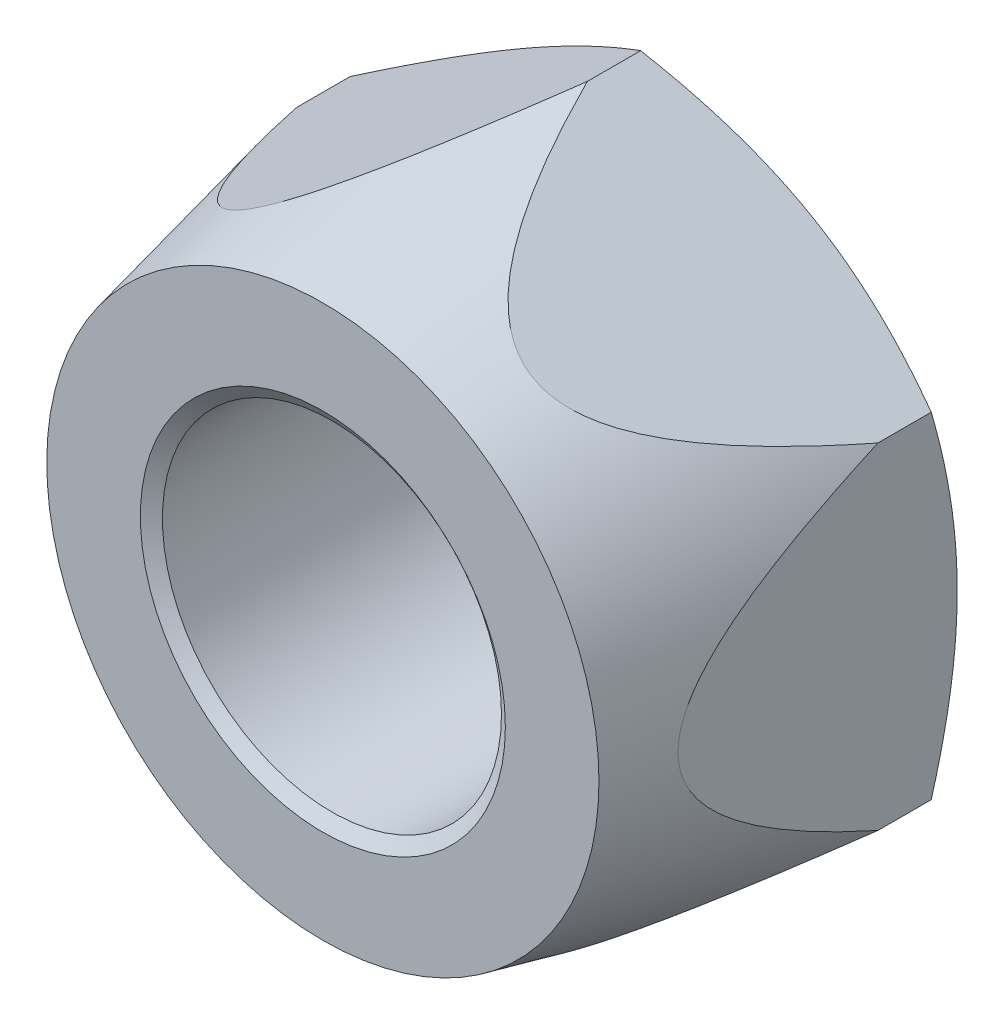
ISO-10303-21;
HEADER;
FILE_DESCRIPTION(('STEP AP214'),'2;1');
FILE_NAME('part.step','',(''),(''),'','','');
FILE_SCHEMA(('AUTOMOTIVE_DESIGN { 1 0 10303 214 1 1 1 1 }'));
ENDSEC;
DATA;
#1=APPLICATION_CONTEXT('core data for automotive mechanical design processes');
#2=APPLICATION_PROTOCOL_DEFINITION('international standard','automotive_design',2000,#1);
#3=PRODUCT_CONTEXT('',#1,'mechanical');
#4=PRODUCT('Part','Part','',(#3));
#5=PRODUCT_RELATED_PRODUCT_CATEGORY('part','',(#4));
#6=PRODUCT_DEFINITION_FORMATION('','',#4);
#7=PRODUCT_DEFINITION_CONTEXT('part definition',#1,'design');
#8=PRODUCT_DEFINITION('design','',#6,#7);
#9=PRODUCT_DEFINITION_SHAPE('','',#8);
#10=(LENGTH_UNIT() NAMED_UNIT(*) SI_UNIT(.MILLI.,.METRE.));
#11=(NAMED_UNIT(*) PLANE_ANGLE_UNIT() SI_UNIT($,.RADIAN.));
#12=(NAMED_UNIT(*) SI_UNIT($,.STERADIAN.) SOLID_ANGLE_UNIT());
#13=UNCERTAINTY_MEASURE_WITH_UNIT(LENGTH_MEASURE(1.E-05),#10,'distance_accuracy_value','');
#14=(GEOMETRIC_REPRESENTATION_CONTEXT(3) GLOBAL_UNCERTAINTY_ASSIGNED_CONTEXT((#13)) GLOBAL_UNIT_ASSIGNED_CONTEXT((#10,
#11,#12)) REPRESENTATION_CONTEXT('',''));
#15=CARTESIAN_POINT('',(0.,0.,0.));
#16=DIRECTION('',(0.,0.,1.));
#17=DIRECTION('',(1.,0.,0.));
#18=AXIS2_PLACEMENT_3D('',#15,#16,#17);
#19=CARTESIAN_POINT('',(0.,0.,-22.5298));
#20=DIRECTION('',(0.,0.,1.));
#21=DIRECTION('',(1.,0.,0.));
#22=AXIS2_PLACEMENT_3D('',#19,#20,#21);
#23=CYLINDRICAL_SURFACE('',#22,11.1125);
#24=CARTESIAN_POINT('',(0.,0.,-0.595176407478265));
#25=DIRECTION('',(0.,0.,1.));
#26=DIRECTION('',(1.,0.,0.));
#27=AXIS2_PLACEMENT_3D('',#24,#25,#26);
#28=CIRCLE('',#27,11.1125);
#29=CARTESIAN_POINT('',(11.1125,0.,-0.595176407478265));
#30=VERTEX_POINT('',#29);
#31=EDGE_CURVE('E149',#30,#30,#28,.F.);
#32=ORIENTED_EDGE('',*,*,#31,.F.);
#33=EDGE_LOOP('',(#32));
#34=FACE_BOUND('',#33,.T.);
#35=CARTESIAN_POINT('',(0.,0.,-21.9092235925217));
#36=DIRECTION('',(0.,0.,-1.));
#37=DIRECTION('',(-1.,0.,0.));
#38=AXIS2_PLACEMENT_3D('',#35,#36,#37);
#39=CIRCLE('',#38,11.1125);
#40=CARTESIAN_POINT('',(-11.1125,0.,-21.9092235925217));
#41=VERTEX_POINT('',#40);
#42=EDGE_CURVE('E38',#41,#41,#39,.F.);
#43=ORIENTED_EDGE('',*,*,#42,.F.);
#44=EDGE_LOOP('',(#43));
#45=FACE_BOUND('',#44,.T.);
#46=ADVANCED_FACE('F33',(#34,#45),#23,.F.);
#47=CARTESIAN_POINT('',(0.,21.9970452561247,-22.5298));
#48=DIRECTION('',(0.,0.,-1.));
#49=DIRECTION('',(-1.,0.,0.));
#50=AXIS2_PLACEMENT_3D('',#47,#48,#49);
#51=PLANE('',#50);
#52=CARTESIAN_POINT('',(0.,0.,-22.5298));
#53=DIRECTION('',(0.,0.,-1.));
#54=DIRECTION('',(-1.,0.,0.));
#55=AXIS2_PLACEMENT_3D('',#52,#53,#54);
#56=CIRCLE('',#55,19.05);
#57=CARTESIAN_POINT('',(-19.05,0.,-22.5298));
#58=VERTEX_POINT('',#57);
#59=CARTESIAN_POINT('',(-9.525,-16.4977839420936,-22.5298));
#60=VERTEX_POINT('',#59);
#61=EDGE_CURVE('E11',#58,#60,#56,.F.);
#62=ORIENTED_EDGE('',*,*,#61,.F.);
#63=CARTESIAN_POINT('',(-9.52500000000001,16.4977839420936,-22.5298));
#64=VERTEX_POINT('',#63);
#65=EDGE_CURVE('E45',#64,#58,#56,.F.);
#66=ORIENTED_EDGE('',*,*,#65,.F.);
#67=CARTESIAN_POINT('',(9.525,16.4977839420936,-22.5298));
#68=VERTEX_POINT('',#67);
#69=EDGE_CURVE('E148',#68,#64,#56,.F.);
#70=ORIENTED_EDGE('',*,*,#69,.F.);
#71=CARTESIAN_POINT('',(0.,0.,-22.5298));
#72=DIRECTION('',(0.,0.,1.));
#73=DIRECTION('',(1.,0.,0.));
#74=AXIS2_PLACEMENT_3D('',#71,#72,#73);
#75=CIRCLE('',#74,19.05);
#76=CARTESIAN_POINT('',(19.05,0.,-22.5298));
#77=VERTEX_POINT('',#76);
#78=EDGE_CURVE('E321',#77,#68,#75,.T.);
#79=ORIENTED_EDGE('',*,*,#78,.F.);
#80=CARTESIAN_POINT('',(9.52500000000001,-16.4977839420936,-22.5298));
#81=VERTEX_POINT('',#80);
#82=EDGE_CURVE('E316',#81,#77,#56,.F.);
#83=ORIENTED_EDGE('',*,*,#82,.F.);
#84=EDGE_CURVE('E43',#60,#81,#56,.F.);
#85=ORIENTED_EDGE('',*,*,#84,.F.);
#86=EDGE_LOOP('',(#62,#66,#70,#79,#83,#85));
#87=FACE_BOUND('',#86,.T.);
#88=CARTESIAN_POINT('',(0.,0.,-22.5298));
#89=DIRECTION('',(0.,0.,-1.));
#90=DIRECTION('',(-1.,0.,0.));
#91=AXIS2_PLACEMENT_3D('',#88,#89,#90);
#92=CIRCLE('',#91,11.9625);
#93=CARTESIAN_POINT('',(-11.9625,0.,-22.5298));
#94=VERTEX_POINT('',#93);
#95=EDGE_CURVE('E153',#94,#94,#92,.F.);
#96=ORIENTED_EDGE('',*,*,#95,.T.);
#97=EDGE_LOOP('',(#96));
#98=FACE_BOUND('',#97,.T.);
#99=ADVANCED_FACE('F265',(#87,#98),#51,.T.);
#100=CARTESIAN_POINT('',(0.,21.9970452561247,0.));
#101=DIRECTION('',(0.,0.,-1.));
#102=DIRECTION('',(-1.,0.,0.));
#103=AXIS2_PLACEMENT_3D('',#100,#101,#102);
#104=PLANE('',#103);
#105=CARTESIAN_POINT('',(0.,0.,0.));
#106=DIRECTION('',(0.,0.,1.));
#107=DIRECTION('',(1.,0.,0.));
#108=AXIS2_PLACEMENT_3D('',#105,#106,#107);
#109=CIRCLE('',#108,18.0975);
#110=CARTESIAN_POINT('',(18.0975,0.,0.));
#111=VERTEX_POINT('',#110);
#112=EDGE_CURVE('E151',#111,#111,#109,.T.);
#113=ORIENTED_EDGE('',*,*,#112,.T.);
#114=EDGE_LOOP('',(#113));
#115=FACE_BOUND('',#114,.T.);
#116=CARTESIAN_POINT('',(0.,0.,0.));
#117=DIRECTION('',(0.,0.,1.));
#118=DIRECTION('',(1.,0.,0.));
#119=AXIS2_PLACEMENT_3D('',#116,#117,#118);
#120=CIRCLE('',#119,11.9625);
#121=CARTESIAN_POINT('',(11.9625,0.,0.));
#122=VERTEX_POINT('',#121);
#123=EDGE_CURVE('E152',#122,#122,#120,.T.);
#124=ORIENTED_EDGE('',*,*,#123,.F.);
#125=EDGE_LOOP('',(#124));
#126=FACE_BOUND('',#125,.T.);
#127=ADVANCED_FACE('F217',(#115,#126),#104,.F.);
#128=CARTESIAN_POINT('',(0.,21.9970452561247,-22.5298));
#129=DIRECTION('',(-0.5,0.866025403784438,0.));
#130=DIRECTION('',(-0.866025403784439,-0.5,0.));
#131=AXIS2_PLACEMENT_3D('',#128,#129,#130);
#132=PLANE('',#131);
#133=DIRECTION('',(0.,0.,1.));
#134=VECTOR('',#133,1.);
#135=CARTESIAN_POINT('',(-19.05,10.9985226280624,-22.5298));
#136=LINE('',#135,#134);
#137=CARTESIAN_POINT('',(-19.05,10.9985226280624,-20.8283226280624));
#138=VERTEX_POINT('',#137);
#139=CARTESIAN_POINT('',(-19.05,10.9985226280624,-17.3300273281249));
#140=VERTEX_POINT('',#139);
#141=EDGE_CURVE('E143',#138,#140,#136,.T.);
#142=ORIENTED_EDGE('',*,*,#141,.T.);
#143=CARTESIAN_POINT('',(-19.0500779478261,10.998477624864,-17.3302273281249));
#144=CARTESIAN_POINT('',(-18.9203652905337,11.0733672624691,-16.9974465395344));
#145=CARTESIAN_POINT('',(-18.7890223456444,11.1491981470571,-16.665504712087));
#146=CARTESIAN_POINT('',(-18.5226506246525,11.3029879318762,-16.0035660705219));
#147=CARTESIAN_POINT('',(-18.3876215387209,11.3809470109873,-15.6735694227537));
#148=CARTESIAN_POINT('',(-18.1132037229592,11.5393822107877,-15.0151959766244));
#149=CARTESIAN_POINT('',(-17.973806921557,11.6198629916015,-14.6868236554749));
#150=CARTESIAN_POINT('',(-17.690397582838,11.7834894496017,-14.0327525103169));
#151=CARTESIAN_POINT('',(-17.5463851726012,11.8666350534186,-13.7070536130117));
#152=CARTESIAN_POINT('',(-17.252491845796,12.0363144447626,-13.0573933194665));
#153=CARTESIAN_POINT('',(-17.1025881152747,12.1228614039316,-12.733445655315));
#154=CARTESIAN_POINT('',(-16.7967574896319,12.2994327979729,-12.0893660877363));
#155=CARTESIAN_POINT('',(-16.6408307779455,12.3894571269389,-11.7692340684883));
#156=CARTESIAN_POINT('',(-16.3221466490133,12.5734494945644,-11.1338419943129));
#157=CARTESIAN_POINT('',(-16.1593944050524,12.6674145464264,-10.8185784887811));
#158=CARTESIAN_POINT('',(-15.8258265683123,12.8600000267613,-10.1938119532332));
#159=CARTESIAN_POINT('',(-15.6550119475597,12.9586198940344,-9.88430823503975));
#160=CARTESIAN_POINT('',(-15.3572524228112,13.1305314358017,-9.365582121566));
#161=CARTESIAN_POINT('',(-15.2327608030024,13.2024067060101,-9.15448268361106));
#162=CARTESIAN_POINT('',(-14.9785571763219,13.3491712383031,-8.73648456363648));
#163=CARTESIAN_POINT('',(-14.8488448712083,13.4240606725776,-8.52958612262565));
#164=CARTESIAN_POINT('',(-14.5833030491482,13.5773713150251,-8.12058191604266));
#165=CARTESIAN_POINT('',(-14.4474645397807,13.6557977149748,-7.91848390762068));
#166=CARTESIAN_POINT('',(-14.1690192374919,13.8165581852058,-7.52059105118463));
#167=CARTESIAN_POINT('',(-14.0264127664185,13.8988920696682,-7.32479590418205));
#168=CARTESIAN_POINT('',(-13.7321274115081,14.0687977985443,-6.93935829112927));
#169=CARTESIAN_POINT('',(-13.5803790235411,14.1564097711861,-6.74978617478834));
#170=CARTESIAN_POINT('',(-13.267744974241,14.3369091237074,-6.38078468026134));
#171=CARTESIAN_POINT('',(-13.1068566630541,14.4297980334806,-6.20135827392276));
#172=CARTESIAN_POINT('',(-12.7750982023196,14.6213388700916,-5.85619254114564));
#173=CARTESIAN_POINT('',(-12.6042556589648,14.7199748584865,-5.69041817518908));
#174=CARTESIAN_POINT('',(-12.2510227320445,14.9239139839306,-5.37633467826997));
#175=CARTESIAN_POINT('',(-12.0686422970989,15.0292113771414,-5.22801080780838));
#176=CARTESIAN_POINT('',(-11.6755229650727,15.2561789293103,-4.94293229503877));
#177=CARTESIAN_POINT('',(-11.4636866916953,15.3784826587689,-4.80815889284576));
#178=CARTESIAN_POINT('',(-11.0252113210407,15.6316365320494,-4.57501453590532));
#179=CARTESIAN_POINT('',(-10.79858779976,15.7624776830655,-4.47660598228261));
#180=CARTESIAN_POINT('',(-10.4487960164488,15.9644300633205,-4.36348923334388));
#181=CARTESIAN_POINT('',(-10.3297508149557,16.0331608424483,-4.33143996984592));
#182=CARTESIAN_POINT('',(-10.0896083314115,16.1718071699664,-4.28035178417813));
#183=CARTESIAN_POINT('',(-9.96851212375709,16.2417220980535,-4.26130625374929));
#184=CARTESIAN_POINT('',(-9.7253265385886,16.3821253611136,-4.23696429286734));
#185=CARTESIAN_POINT('',(-9.60323759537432,16.4526134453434,-4.23166214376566));
#186=CARTESIAN_POINT('',(-9.35923620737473,16.5934877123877,-4.2349725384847));
#187=CARTESIAN_POINT('',(-9.23732375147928,16.6638739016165,-4.24358416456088));
#188=CARTESIAN_POINT('',(-8.90262826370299,16.8571104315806,-4.28619949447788));
#189=CARTESIAN_POINT('',(-8.69111517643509,16.9792275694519,-4.33451600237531));
#190=CARTESIAN_POINT('',(-8.27730230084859,17.2181425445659,-4.46813124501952));
#191=CARTESIAN_POINT('',(-8.07500879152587,17.3349367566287,-4.55345477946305));
#192=CARTESIAN_POINT('',(-7.56764496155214,17.6278634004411,-4.8120084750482));
#193=CARTESIAN_POINT('',(-7.27111030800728,17.7990677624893,-5.00751366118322));
#194=CARTESIAN_POINT('',(-6.84822980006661,18.0432179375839,-5.33712739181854));
#195=CARTESIAN_POINT('',(-6.71065999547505,18.1226439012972,-5.45333786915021));
#196=CARTESIAN_POINT('',(-6.4422246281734,18.2776251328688,-5.69570318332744));
#197=CARTESIAN_POINT('',(-6.31135775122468,18.3531811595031,-5.8218560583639));
#198=CARTESIAN_POINT('',(-6.01765662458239,18.5227495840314,-6.12102661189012));
#199=CARTESIAN_POINT('',(-5.85693954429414,18.6155396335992,-6.29679360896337));
#200=CARTESIAN_POINT('',(-5.54455043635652,18.7958975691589,-6.65879612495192));
#201=CARTESIAN_POINT('',(-5.39288209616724,18.8834633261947,-6.8450358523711));
#202=CARTESIAN_POINT('',(-5.09724688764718,19.0541483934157,-7.22598429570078));
#203=CARTESIAN_POINT('',(-4.95329260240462,19.1372604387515,-7.42070596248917));
#204=CARTESIAN_POINT('',(-4.67231035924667,19.2994856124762,-7.81672312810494));
#205=CARTESIAN_POINT('',(-4.5352836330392,19.3785980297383,-8.01801978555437));
#206=CARTESIAN_POINT('',(-4.13134673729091,19.6118111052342,-8.6327607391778));
#207=CARTESIAN_POINT('',(-3.8736666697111,19.7605827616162,-9.05429523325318));
#208=CARTESIAN_POINT('',(-3.37729230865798,20.047164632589,-9.91202255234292));
#209=CARTESIAN_POINT('',(-3.13860514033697,20.1849707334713,-10.3482207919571));
#210=CARTESIAN_POINT('',(-2.76838063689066,20.3987199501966,-11.0555289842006));
#211=CARTESIAN_POINT('',(-2.63199202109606,20.47746395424,-11.3232807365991));
#212=CARTESIAN_POINT('',(-2.36411715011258,20.6321215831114,-11.8619558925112));
#213=CARTESIAN_POINT('',(-2.23262987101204,20.7080357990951,-12.1328786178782));
#214=CARTESIAN_POINT('',(-1.84448218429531,20.9321329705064,-12.9500141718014));
#215=CARTESIAN_POINT('',(-1.59427799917,21.0765884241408,-13.5003195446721));
#216=CARTESIAN_POINT('',(-1.11409491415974,21.3538222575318,-14.5943138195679));
#217=CARTESIAN_POINT('',(-0.883756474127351,21.4868082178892,-15.1377939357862));
#218=CARTESIAN_POINT('',(-0.546456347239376,21.6815485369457,-15.9571884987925));
#219=CARTESIAN_POINT('',(-0.435439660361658,21.7456440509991,-16.2308899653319));
#220=CARTESIAN_POINT('',(-0.215881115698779,21.8724062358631,-16.7796087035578));
#221=CARTESIAN_POINT('',(-0.107339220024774,21.9350729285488,-17.0546259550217));
#222=CARTESIAN_POINT('',(7.79478261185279E-05,21.9970902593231,-17.3302273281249));
#223=B_SPLINE_CURVE_WITH_KNOTS('',3,(#143,#144,#145,#146,#147,#148,#149,#150,#151,#152,#153,
#154,#155,#156,#157,#158,#159,#160,#161,#162,#163,#164,#165,#166,#167,#168,#169,#170,#171,#172,
#173,#174,#175,#176,#177,#178,#179,#180,#181,#182,#183,#184,#185,#186,#187,#188,#189,#190,#191,
#192,#193,#194,#195,#196,#197,#198,#199,#200,#201,#202,#203,#204,#205,#206,#207,#208,#209,#210,
#211,#212,#213,#214,#215,#216,#217,#218,#219,#220,#221,#222),.UNSPECIFIED.,.F.,.F.,(4,2,2,2,2,2,
2,2,2,2,2,2,2,2,2,2,2,2,2,2,2,2,2,2,2,2,2,2,2,2,2,2,2,2,2,2,2,2,2,4),(0.,1.09480767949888,
2.1897076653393,3.28676663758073,4.38379543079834,5.48559891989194,6.58736887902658,
7.68831835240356,8.78913542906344,9.55523670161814,10.3213818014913,11.0886906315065,
11.8559630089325,12.6300706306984,13.4044038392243,14.1766833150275,14.9483057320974,
15.7839555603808,16.6187389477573,17.041655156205,17.4643562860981,17.8868815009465,
18.3093788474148,19.0525932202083,19.7963064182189,20.9719066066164,21.5621679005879,
22.1523130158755,22.9186023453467,23.6852018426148,24.4530159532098,25.2209661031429,
26.7678334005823,28.3152782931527,29.2471138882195,30.1787537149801,32.042992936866,
33.8580229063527,34.7647111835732,35.6713855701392),.UNSPECIFIED.);
#224=CARTESIAN_POINT('',(0.,21.9970452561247,-17.3300273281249));
#225=VERTEX_POINT('',#224);
#226=EDGE_CURVE('E52',#140,#225,#223,.T.);
#227=ORIENTED_EDGE('',*,*,#226,.T.);
#228=DIRECTION('',(0.,0.,1.));
#229=VECTOR('',#228,1.);
#230=CARTESIAN_POINT('',(0.,21.9970452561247,-22.5298));
#231=LINE('',#230,#229);
#232=CARTESIAN_POINT('',(0.,21.9970452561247,-20.8283226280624));
#233=VERTEX_POINT('',#232);
#234=EDGE_CURVE('E125',#233,#225,#231,.T.);
#235=ORIENTED_EDGE('',*,*,#234,.F.);
#236=CARTESIAN_POINT('',(-19.0502,10.9984071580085,-20.8282559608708));
#237=CARTESIAN_POINT('',(-18.6314889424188,11.2401500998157,-20.9678165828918));
#238=CARTESIAN_POINT('',(-18.2111446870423,11.4828359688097,-21.1010441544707));
#239=CARTESIAN_POINT('',(-17.3670855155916,11.9701537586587,-21.3530728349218));
#240=CARTESIAN_POINT('',(-16.9433695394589,12.2147862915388,-21.4718691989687));
#241=CARTESIAN_POINT('',(-16.0917480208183,12.7064702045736,-21.6934385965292));
#242=CARTESIAN_POINT('',(-15.6638350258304,12.9535258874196,-21.7961737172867));
#243=CARTESIAN_POINT('',(-14.8050356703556,13.4493539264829,-21.9834145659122));
#244=CARTESIAN_POINT('',(-14.374149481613,13.6981261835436,-22.0679213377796));
#245=CARTESIAN_POINT('',(-13.5204444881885,14.1910129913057,-22.2151111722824));
#246=CARTESIAN_POINT('',(-13.0976890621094,14.4350909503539,-22.2782814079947));
#247=CARTESIAN_POINT('',(-12.250241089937,14.9243652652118,-22.3842036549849));
#248=CARTESIAN_POINT('',(-11.8255485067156,15.1695616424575,-22.4269552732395));
#249=CARTESIAN_POINT('',(-10.9754499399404,15.6603662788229,-22.4909608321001));
#250=CARTESIAN_POINT('',(-10.5500454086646,15.9059736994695,-22.5122403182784));
#251=CARTESIAN_POINT('',(-9.69884369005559,16.397415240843,-22.532843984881));
#252=CARTESIAN_POINT('',(-9.27304651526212,16.6432493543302,-22.5321688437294));
#253=CARTESIAN_POINT('',(-8.47700964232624,17.1028414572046,-22.5103966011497));
#254=CARTESIAN_POINT('',(-8.10671322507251,17.316632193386,-22.4919544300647));
#255=CARTESIAN_POINT('',(-7.3670036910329,17.7437036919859,-22.4388155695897));
#256=CARTESIAN_POINT('',(-6.99759056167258,17.9569844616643,-22.4041191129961));
#257=CARTESIAN_POINT('',(-6.25978756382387,18.3829552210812,-22.3190737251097));
#258=CARTESIAN_POINT('',(-5.89139892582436,18.5956445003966,-22.2687106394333));
#259=CARTESIAN_POINT('',(-5.1563753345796,19.0200105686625,-22.1532206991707));
#260=CARTESIAN_POINT('',(-4.7897403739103,19.2316873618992,-22.0880939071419));
#261=CARTESIAN_POINT('',(-3.67677271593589,19.8742595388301,-21.8689116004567));
#262=CARTESIAN_POINT('',(-2.93366305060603,20.3032941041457,-21.6930008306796));
#263=CARTESIAN_POINT('',(-1.45852420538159,21.1549659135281,-21.2937556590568));
#264=CARTESIAN_POINT('',(-0.726476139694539,21.5776140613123,-21.0705150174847));
#265=CARTESIAN_POINT('',(0.000199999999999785,21.9971607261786,-20.8282559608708));
#266=B_SPLINE_CURVE_WITH_KNOTS('',3,(#236,#237,#238,#239,#240,#241,#242,#243,#244,#245,#246,
#247,#248,#249,#250,#251,#252,#253,#254,#255,#256,#257,#258,#259,#260,#261,#262,#263,#264,#265),
.UNSPECIFIED.,.F.,.F.,(4,2,2,2,2,2,2,2,2,2,2,2,2,2,4),(0.,1.50971559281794,3.01992622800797,
4.53364959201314,6.04728623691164,7.52356313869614,8.99986845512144,10.4744153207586,
11.9489166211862,13.2325441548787,14.5161533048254,15.8009255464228,17.085692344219,
19.7118183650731,22.3327898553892),.UNSPECIFIED.);
#267=EDGE_CURVE('E145',#64,#233,#266,.T.);
#268=ORIENTED_EDGE('',*,*,#267,.F.);
#269=EDGE_CURVE('E227',#138,#64,#266,.T.);
#270=ORIENTED_EDGE('',*,*,#269,.F.);
#271=EDGE_LOOP('',(#142,#227,#235,#268,#270));
#272=FACE_BOUND('',#271,.T.);
#273=ADVANCED_FACE('F35',(#272),#132,.T.);
#274=CARTESIAN_POINT('',(19.05,10.9985226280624,-22.5298));
#275=DIRECTION('',(0.5,0.866025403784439,0.));
#276=DIRECTION('',(-0.866025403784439,0.5,0.));
#277=AXIS2_PLACEMENT_3D('',#274,#275,#276);
#278=PLANE('',#277);
#279=ORIENTED_EDGE('',*,*,#234,.T.);
#280=CARTESIAN_POINT('',(-7.79478261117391E-05,21.9970902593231,-17.3302273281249));
#281=CARTESIAN_POINT('',(0.129634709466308,21.9222006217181,-16.9974465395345));
#282=CARTESIAN_POINT('',(0.260977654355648,21.84636973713,-16.665504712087));
#283=CARTESIAN_POINT('',(0.52734937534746,21.6925799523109,-16.003566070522));
#284=CARTESIAN_POINT('',(0.662378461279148,21.6146208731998,-15.6735694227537));
#285=CARTESIAN_POINT('',(0.936796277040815,21.4561856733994,-15.0151959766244));
#286=CARTESIAN_POINT('',(1.07619307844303,21.3757048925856,-14.6868236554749));
#287=CARTESIAN_POINT('',(1.35960241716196,21.2120784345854,-14.0327525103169));
#288=CARTESIAN_POINT('',(1.50361482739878,21.1289328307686,-13.7070536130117));
#289=CARTESIAN_POINT('',(1.79750815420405,20.9592534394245,-13.0573933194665));
#290=CARTESIAN_POINT('',(1.94741188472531,20.8727064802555,-12.733445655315));
#291=CARTESIAN_POINT('',(2.25324251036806,20.6961350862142,-12.0893660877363));
#292=CARTESIAN_POINT('',(2.40916922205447,20.6061107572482,-11.7692340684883));
#293=CARTESIAN_POINT('',(2.72785335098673,20.4221183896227,-11.1338419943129));
#294=CARTESIAN_POINT('',(2.89060559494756,20.3281533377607,-10.8185784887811));
#295=CARTESIAN_POINT('',(3.22417343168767,20.1355678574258,-10.1938119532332));
#296=CARTESIAN_POINT('',(3.39498805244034,20.0369479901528,-9.88430823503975));
#297=CARTESIAN_POINT('',(3.69274757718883,19.8650364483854,-9.365582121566));
#298=CARTESIAN_POINT('',(3.81723919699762,19.793161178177,-9.15448268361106));
#299=CARTESIAN_POINT('',(4.07144282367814,19.646396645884,-8.73648456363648));
#300=CARTESIAN_POINT('',(4.20115512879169,19.5715072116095,-8.52958612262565));
#301=CARTESIAN_POINT('',(4.46669695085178,19.418196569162,-8.12058191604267));
#302=CARTESIAN_POINT('',(4.60253546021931,19.3397701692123,-7.91848390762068));
#303=CARTESIAN_POINT('',(4.8809807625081,19.1790096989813,-7.52059105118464));
#304=CARTESIAN_POINT('',(5.02358723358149,19.0966758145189,-7.32479590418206));
#305=CARTESIAN_POINT('',(5.31787258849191,18.9267700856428,-6.93935829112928));
#306=CARTESIAN_POINT('',(5.4696209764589,18.839158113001,-6.74978617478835));
#307=CARTESIAN_POINT('',(5.78225502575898,18.6586587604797,-6.38078468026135));
#308=CARTESIAN_POINT('',(5.94314333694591,18.5657698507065,-6.20135827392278));
#309=CARTESIAN_POINT('',(6.27490179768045,18.3742290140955,-5.85619254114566));
#310=CARTESIAN_POINT('',(6.44574434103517,18.2755930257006,-5.6904181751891));
#311=CARTESIAN_POINT('',(6.79897726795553,18.0716539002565,-5.37633467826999));
#312=CARTESIAN_POINT('',(6.98135770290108,17.9663565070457,-5.22801080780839));
#313=CARTESIAN_POINT('',(7.37447703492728,17.7393889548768,-4.94293229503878));
#314=CARTESIAN_POINT('',(7.58631330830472,17.6170852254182,-4.80815889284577));
#315=CARTESIAN_POINT('',(8.02478867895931,17.3639313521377,-4.57501453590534));
#316=CARTESIAN_POINT('',(8.25141220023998,17.2330902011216,-4.47660598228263));
#317=CARTESIAN_POINT('',(8.60120398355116,17.0311378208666,-4.36348923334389));
#318=CARTESIAN_POINT('',(8.72024918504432,16.9624070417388,-4.33143996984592));
#319=CARTESIAN_POINT('',(8.96039166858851,16.8237607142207,-4.28035178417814));
#320=CARTESIAN_POINT('',(9.08148787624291,16.7538457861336,-4.26130625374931));
#321=CARTESIAN_POINT('',(9.3246734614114,16.6134425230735,-4.23696429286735));
#322=CARTESIAN_POINT('',(9.44676240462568,16.5429544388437,-4.23166214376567));
#323=CARTESIAN_POINT('',(9.69076379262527,16.4020801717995,-4.23497253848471));
#324=CARTESIAN_POINT('',(9.81267624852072,16.3316939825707,-4.2435841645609));
#325=CARTESIAN_POINT('',(10.147371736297,16.1384574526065,-4.2861994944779));
#326=CARTESIAN_POINT('',(10.3588848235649,16.0163403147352,-4.33451600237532));
#327=CARTESIAN_POINT('',(10.7726976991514,15.7774253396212,-4.46813124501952));
#328=CARTESIAN_POINT('',(10.9749912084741,15.6606311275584,-4.55345477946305));
#329=CARTESIAN_POINT('',(11.4823550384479,15.367704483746,-4.81200847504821));
#330=CARTESIAN_POINT('',(11.7788896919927,15.1965001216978,-5.00751366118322));
#331=CARTESIAN_POINT('',(12.2017701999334,14.9523499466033,-5.33712739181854));
#332=CARTESIAN_POINT('',(12.339340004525,14.8729239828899,-5.45333786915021));
#333=CARTESIAN_POINT('',(12.6077753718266,14.7179427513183,-5.69570318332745));
#334=CARTESIAN_POINT('',(12.7386422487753,14.642386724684,-5.82185605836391));
#335=CARTESIAN_POINT('',(13.0323433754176,14.4728183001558,-6.12102661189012));
#336=CARTESIAN_POINT('',(13.1930604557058,14.380028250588,-6.29679360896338));
#337=CARTESIAN_POINT('',(13.5054495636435,14.1996703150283,-6.65879612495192));
#338=CARTESIAN_POINT('',(13.6571179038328,14.1121045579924,-6.84503585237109));
#339=CARTESIAN_POINT('',(13.9527531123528,13.9414194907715,-7.22598429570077));
#340=CARTESIAN_POINT('',(14.0967073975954,13.8583074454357,-7.42070596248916));
#341=CARTESIAN_POINT('',(14.3776896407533,13.6960822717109,-7.81672312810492));
#342=CARTESIAN_POINT('',(14.5147163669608,13.6169698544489,-8.01801978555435));
#343=CARTESIAN_POINT('',(14.9186532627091,13.383756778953,-8.63276073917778));
#344=CARTESIAN_POINT('',(15.1763333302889,13.234985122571,-9.05429523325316));
#345=CARTESIAN_POINT('',(15.672707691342,12.9484032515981,-9.91202255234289));
#346=CARTESIAN_POINT('',(15.911394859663,12.8105971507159,-10.348220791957));
#347=CARTESIAN_POINT('',(16.2816193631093,12.5968479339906,-11.0555289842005));
#348=CARTESIAN_POINT('',(16.4180079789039,12.5181039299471,-11.3232807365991));
#349=CARTESIAN_POINT('',(16.6858828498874,12.3634463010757,-11.8619558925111));
#350=CARTESIAN_POINT('',(16.8173701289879,12.287532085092,-12.1328786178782));
#351=CARTESIAN_POINT('',(17.2055178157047,12.0634349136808,-12.9500141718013));
#352=CARTESIAN_POINT('',(17.45572200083,11.9189794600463,-13.5003195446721));
#353=CARTESIAN_POINT('',(17.9359050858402,11.6417456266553,-14.5943138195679));
#354=CARTESIAN_POINT('',(18.1662435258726,11.5087596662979,-15.1377939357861));
#355=CARTESIAN_POINT('',(18.5035436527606,11.3140193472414,-15.9571884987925));
#356=CARTESIAN_POINT('',(18.6145603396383,11.249923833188,-16.2308899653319));
#357=CARTESIAN_POINT('',(18.8341188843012,11.123161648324,-16.7796087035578));
#358=CARTESIAN_POINT('',(18.9426607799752,11.0604949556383,-17.0546259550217));
#359=CARTESIAN_POINT('',(19.0500779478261,10.998477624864,-17.3302273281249));
#360=B_SPLINE_CURVE_WITH_KNOTS('',3,(#280,#281,#282,#283,#284,#285,#286,#287,#288,#289,#290,
#291,#292,#293,#294,#295,#296,#297,#298,#299,#300,#301,#302,#303,#304,#305,#306,#307,#308,#309,
#310,#311,#312,#313,#314,#315,#316,#317,#318,#319,#320,#321,#322,#323,#324,#325,#326,#327,#328,
#329,#330,#331,#332,#333,#334,#335,#336,#337,#338,#339,#340,#341,#342,#343,#344,#345,#346,#347,
#348,#349,#350,#351,#352,#353,#354,#355,#356,#357,#358,#359),.UNSPECIFIED.,.F.,.F.,(4,2,2,2,2,2,
2,2,2,2,2,2,2,2,2,2,2,2,2,2,2,2,2,2,2,2,2,2,2,2,2,2,2,2,2,2,2,2,2,4),(0.,1.09480767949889,
2.1897076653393,3.28676663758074,4.38379543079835,5.48559891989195,6.5873688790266,
7.68831835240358,8.78913542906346,9.55523670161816,10.3213818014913,11.0886906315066,
11.8559630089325,12.6300706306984,13.4044038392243,14.1766833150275,14.9483057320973,
15.7839555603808,16.6187389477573,17.041655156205,17.4643562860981,17.8868815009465,
18.3093788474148,19.0525932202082,19.7963064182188,20.9719066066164,21.5621679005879,
22.1523130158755,22.9186023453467,23.6852018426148,24.4530159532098,25.2209661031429,
26.7678334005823,28.3152782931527,29.2471138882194,30.17875371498,32.042992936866,
33.8580229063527,34.7647111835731,35.6713855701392),.UNSPECIFIED.);
#361=CARTESIAN_POINT('',(19.05,10.9985226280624,-17.3300273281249));
#362=VERTEX_POINT('',#361);
#363=EDGE_CURVE('E109',#225,#362,#360,.T.);
#364=ORIENTED_EDGE('',*,*,#363,.T.);
#365=DIRECTION('',(0.,0.,1.));
#366=VECTOR('',#365,1.);
#367=CARTESIAN_POINT('',(19.05,10.9985226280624,-22.5298));
#368=LINE('',#367,#366);
#369=CARTESIAN_POINT('',(19.05,10.9985226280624,-20.8283226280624));
#370=VERTEX_POINT('',#369);
#371=EDGE_CURVE('E122',#370,#362,#368,.T.);
#372=ORIENTED_EDGE('',*,*,#371,.F.);
#373=CARTESIAN_POINT('',(-0.000200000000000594,21.9971607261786,-20.8282559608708));
#374=CARTESIAN_POINT('',(0.418511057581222,21.7554177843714,-20.9678165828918));
#375=CARTESIAN_POINT('',(0.838855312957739,21.5127319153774,-21.1010441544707));
#376=CARTESIAN_POINT('',(1.68291448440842,21.0254141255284,-21.3530728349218));
#377=CARTESIAN_POINT('',(2.10663046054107,20.7807815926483,-21.4718691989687));
#378=CARTESIAN_POINT('',(2.95825197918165,20.2890976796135,-21.6934385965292));
#379=CARTESIAN_POINT('',(3.38616497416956,20.0420419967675,-21.7961737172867));
#380=CARTESIAN_POINT('',(4.24496432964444,19.5462139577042,-21.9834145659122));
#381=CARTESIAN_POINT('',(4.67585051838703,19.2974417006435,-22.0679213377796));
#382=CARTESIAN_POINT('',(5.52955551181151,18.8045548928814,-22.2151111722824));
#383=CARTESIAN_POINT('',(5.95231093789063,18.5604769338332,-22.2782814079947));
#384=CARTESIAN_POINT('',(6.799758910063,18.0712026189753,-22.3842036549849));
#385=CARTESIAN_POINT('',(7.22445149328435,17.8260062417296,-22.4269552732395));
#386=CARTESIAN_POINT('',(8.07455006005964,17.3352016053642,-22.4909608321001));
#387=CARTESIAN_POINT('',(8.49995459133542,17.0895941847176,-22.5122403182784));
#388=CARTESIAN_POINT('',(9.35115630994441,16.5981526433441,-22.532843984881));
#389=CARTESIAN_POINT('',(9.77695348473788,16.3523185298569,-22.5321688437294));
#390=CARTESIAN_POINT('',(10.5729903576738,15.8927264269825,-22.5103966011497));
#391=CARTESIAN_POINT('',(10.9432867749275,15.6789356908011,-22.4919544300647));
#392=CARTESIAN_POINT('',(11.6829963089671,15.2518641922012,-22.4388155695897));
#393=CARTESIAN_POINT('',(12.0524094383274,15.0385834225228,-22.4041191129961));
#394=CARTESIAN_POINT('',(12.7902124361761,14.612612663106,-22.3190737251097));
#395=CARTESIAN_POINT('',(13.1586010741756,14.3999233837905,-22.2687106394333));
#396=CARTESIAN_POINT('',(13.8936246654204,13.9755573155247,-22.1532206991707));
#397=CARTESIAN_POINT('',(14.2602596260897,13.7638805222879,-22.0880939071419));
#398=CARTESIAN_POINT('',(15.3732272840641,13.121308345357,-21.8689116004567));
#399=CARTESIAN_POINT('',(16.116336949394,12.6922737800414,-21.6930008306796));
#400=CARTESIAN_POINT('',(17.5914757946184,11.840601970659,-21.2937556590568));
#401=CARTESIAN_POINT('',(18.3235238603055,11.4179538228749,-21.0705150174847));
#402=CARTESIAN_POINT('',(19.0502,10.9984071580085,-20.8282559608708));
#403=B_SPLINE_CURVE_WITH_KNOTS('',3,(#373,#374,#375,#376,#377,#378,#379,#380,#381,#382,#383,
#384,#385,#386,#387,#388,#389,#390,#391,#392,#393,#394,#395,#396,#397,#398,#399,#400,#401,#402),
.UNSPECIFIED.,.F.,.F.,(4,2,2,2,2,2,2,2,2,2,2,2,2,2,4),(0.,1.50971559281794,3.01992622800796,
4.53364959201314,6.04728623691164,7.52356313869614,8.99986845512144,10.4744153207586,
11.9489166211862,13.2325441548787,14.5161533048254,15.8009255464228,17.085692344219,
19.7118183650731,22.3327898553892),.UNSPECIFIED.);
#404=EDGE_CURVE('E221',#68,#370,#403,.T.);
#405=ORIENTED_EDGE('',*,*,#404,.F.);
#406=EDGE_CURVE('E226',#233,#68,#403,.T.);
#407=ORIENTED_EDGE('',*,*,#406,.F.);
#408=EDGE_LOOP('',(#279,#364,#372,#405,#407));
#409=FACE_BOUND('',#408,.T.);
#410=ADVANCED_FACE('F120',(#409),#278,.T.);
#411=CARTESIAN_POINT('',(19.05,10.9985226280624,-22.5298));
#412=DIRECTION('',(-1.,0.,0.));
#413=DIRECTION('',(0.,0.,1.));
#414=AXIS2_PLACEMENT_3D('',#411,#412,#413);
#415=PLANE('',#414);
#416=CARTESIAN_POINT('',(19.05,-20.8914428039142,-45.2204905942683));
#417=CARTESIAN_POINT('',(19.05,-20.70186094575,-44.5979405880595));
#418=CARTESIAN_POINT('',(19.05,-20.511212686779,-43.9757156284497));
#419=CARTESIAN_POINT('',(19.05,-20.1275933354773,-42.731979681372));
#420=CARTESIAN_POINT('',(19.05,-19.9346222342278,-42.1104686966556));
#421=CARTESIAN_POINT('',(19.05,-19.3518838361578,-40.2469242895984));
#422=CARTESIAN_POINT('',(19.05,-18.9583479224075,-39.0060652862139));
#423=CARTESIAN_POINT('',(19.05,-18.1564718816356,-36.5193179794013));
#424=CARTESIAN_POINT('',(19.05,-17.7480458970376,-35.2734573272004));
#425=CARTESIAN_POINT('',(19.05,-16.9165946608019,-32.7867482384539));
#426=CARTESIAN_POINT('',(19.05,-16.4935710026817,-31.5458992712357));
#427=CARTESIAN_POINT('',(19.05,-15.7991135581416,-29.5565632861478));
#428=CARTESIAN_POINT('',(19.05,-15.5333871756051,-28.806083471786));
#429=CARTESIAN_POINT('',(19.05,-14.994250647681,-27.3078892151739));
#430=CARTESIAN_POINT('',(19.05,-14.7208405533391,-26.5601747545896));
#431=CARTESIAN_POINT('',(19.05,-14.1649904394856,-25.0677539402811));
#432=CARTESIAN_POINT('',(19.05,-13.8825467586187,-24.323048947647));
#433=CARTESIAN_POINT('',(19.05,-13.3071785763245,-22.8377048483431));
#434=CARTESIAN_POINT('',(19.05,-13.0142542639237,-22.0970656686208));
#435=CARTESIAN_POINT('',(19.05,-12.4171220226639,-20.6238248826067));
#436=CARTESIAN_POINT('',(19.05,-12.1129646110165,-19.8912028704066));
#437=CARTESIAN_POINT('',(19.05,-11.4896455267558,-18.432387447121));
#438=CARTESIAN_POINT('',(19.05,-11.1704844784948,-17.7061937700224));
#439=CARTESIAN_POINT('',(19.05,-10.5138228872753,-16.2626574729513));
#440=CARTESIAN_POINT('',(19.05,-10.1763346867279,-15.545309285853));
#441=CARTESIAN_POINT('',(19.05,-9.65246564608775,-14.4780198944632));
#442=CARTESIAN_POINT('',(19.05,-9.47491722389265,-14.1237386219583));
#443=CARTESIAN_POINT('',(19.05,-9.11307921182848,-13.4186403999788));
#444=CARTESIAN_POINT('',(19.05,-8.92878986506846,-13.0678233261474));
#445=CARTESIAN_POINT('',(19.05,-8.56572833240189,-12.394962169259));
#446=CARTESIAN_POINT('',(19.05,-8.38748380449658,-12.0726338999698));
#447=CARTESIAN_POINT('',(19.05,-8.02327371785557,-11.4323278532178));
#448=CARTESIAN_POINT('',(19.05,-7.83730765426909,-11.1143503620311));
#449=CARTESIAN_POINT('',(19.05,-7.45589593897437,-10.482914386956));
#450=CARTESIAN_POINT('',(19.05,-7.26042553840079,-10.1694707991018));
#451=CARTESIAN_POINT('',(19.05,-6.85892617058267,-9.54943187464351));
#452=CARTESIAN_POINT('',(19.05,-6.65289829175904,-9.24283583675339));
#453=CARTESIAN_POINT('',(19.05,-6.23411583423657,-8.64675456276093));
#454=CARTESIAN_POINT('',(19.05,-6.02170276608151,-8.35703063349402));
#455=CARTESIAN_POINT('',(19.05,-5.58252778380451,-7.78835986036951));
#456=CARTESIAN_POINT('',(19.05,-5.35575933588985,-7.50941801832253));
#457=CARTESIAN_POINT('',(19.05,-4.88602774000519,-6.96753678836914));
#458=CARTESIAN_POINT('',(19.05,-4.64313947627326,-6.70453295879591));
#459=CARTESIAN_POINT('',(19.05,-4.13684307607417,-6.19926117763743));
#460=CARTESIAN_POINT('',(19.05,-3.87346181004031,-5.95696691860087));
#461=CARTESIAN_POINT('',(19.05,-3.47238844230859,-5.62622222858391));
#462=CARTESIAN_POINT('',(19.05,-3.34445001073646,-5.52591038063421));
#463=CARTESIAN_POINT('',(19.05,-3.0830449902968,-5.33265242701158));
#464=CARTESIAN_POINT('',(19.05,-2.9495771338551,-5.23970802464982));
#465=CARTESIAN_POINT('',(19.05,-2.67693899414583,-5.06270323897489));
#466=CARTESIAN_POINT('',(19.05,-2.5377720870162,-4.97863769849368));
#467=CARTESIAN_POINT('',(19.05,-2.25362409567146,-4.82106842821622));
#468=CARTESIAN_POINT('',(19.05,-2.10864423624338,-4.74756248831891));
#469=CARTESIAN_POINT('',(19.05,-1.71727247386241,-4.56950913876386));
#470=CARTESIAN_POINT('',(19.05,-1.46585453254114,-4.4755720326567));
#471=CARTESIAN_POINT('',(19.05,-0.950867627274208,-4.33075562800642));
#472=CARTESIAN_POINT('',(19.05,-0.687311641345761,-4.27983141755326));
#473=CARTESIAN_POINT('',(19.05,-0.153499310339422,-4.22743380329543));
#474=CARTESIAN_POINT('',(19.05,0.116788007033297,-4.22626261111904));
#475=CARTESIAN_POINT('',(19.05,0.652831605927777,-4.2743175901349));
#476=CARTESIAN_POINT('',(19.05,0.918584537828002,-4.3235795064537));
#477=CARTESIAN_POINT('',(19.05,1.48369944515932,-4.47857333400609));
#478=CARTESIAN_POINT('',(19.05,1.78068632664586,-4.59275589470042));
#479=CARTESIAN_POINT('',(19.05,2.35261378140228,-4.86674659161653));
#480=CARTESIAN_POINT('',(19.05,2.62751247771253,-5.02663889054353));
#481=CARTESIAN_POINT('',(19.05,3.12381123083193,-5.35762677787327));
#482=CARTESIAN_POINT('',(19.05,3.34768122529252,-5.52511032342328));
#483=CARTESIAN_POINT('',(19.05,3.78034574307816,-5.87869770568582));
#484=CARTESIAN_POINT('',(19.05,3.98912710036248,-6.06481747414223));
#485=CARTESIAN_POINT('',(19.05,4.39405492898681,-6.45149731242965));
#486=CARTESIAN_POINT('',(19.05,4.59015672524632,-6.6521036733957));
#487=CARTESIAN_POINT('',(19.05,4.97075168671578,-7.06379314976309));
#488=CARTESIAN_POINT('',(19.05,5.15525017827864,-7.27487137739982));
#489=CARTESIAN_POINT('',(19.05,5.52228430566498,-7.71473862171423));
#490=CARTESIAN_POINT('',(19.05,5.70437350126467,-7.94389812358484));
#491=CARTESIAN_POINT('',(19.05,6.05932943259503,-8.40927916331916));
#492=CARTESIAN_POINT('',(19.05,6.23219453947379,-8.6455019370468));
#493=CARTESIAN_POINT('',(19.05,6.57006630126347,-9.12376315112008));
#494=CARTESIAN_POINT('',(19.05,6.73506661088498,-9.36580605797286));
#495=CARTESIAN_POINT('',(19.05,7.05810364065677,-9.85450548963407));
#496=CARTESIAN_POINT('',(19.05,7.21613978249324,-10.1011623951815));
#497=CARTESIAN_POINT('',(19.05,7.68201357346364,-10.8482471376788));
#498=CARTESIAN_POINT('',(19.05,7.98066054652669,-11.3544110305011));
#499=CARTESIAN_POINT('',(19.05,8.55879750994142,-12.377561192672));
#500=CARTESIAN_POINT('',(19.05,8.83828427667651,-12.8945492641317));
#501=CARTESIAN_POINT('',(19.05,9.24783381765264,-13.6797987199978));
#502=CARTESIAN_POINT('',(19.05,9.38365717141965,-13.9450776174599));
#503=CARTESIAN_POINT('',(19.05,9.65167622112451,-14.4774278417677));
#504=CARTESIAN_POINT('',(19.05,9.78387228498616,-14.7444989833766));
#505=CARTESIAN_POINT('',(19.05,10.1755915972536,-15.5481678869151));
#506=CARTESIAN_POINT('',(19.05,10.4302131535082,-16.0871577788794));
#507=CARTESIAN_POINT('',(19.05,10.9280176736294,-17.1689855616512));
#508=CARTESIAN_POINT('',(19.05,11.1712237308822,-17.7118128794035));
#509=CARTESIAN_POINT('',(19.05,11.6484092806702,-18.8014722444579));
#510=CARTESIAN_POINT('',(19.05,11.8823891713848,-19.3483041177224));
#511=CARTESIAN_POINT('',(19.05,12.3368139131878,-20.4318772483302));
#512=CARTESIAN_POINT('',(19.05,12.5574497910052,-20.9685385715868));
#513=CARTESIAN_POINT('',(19.05,12.9921536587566,-22.0445173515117));
#514=CARTESIAN_POINT('',(19.05,13.2062215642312,-22.5838348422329));
#515=CARTESIAN_POINT('',(19.05,13.8398258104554,-24.205223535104));
#516=CARTESIAN_POINT('',(19.05,14.2507367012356,-25.2906684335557));
#517=CARTESIAN_POINT('',(19.05,15.0545077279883,-27.4685171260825));
#518=CARTESIAN_POINT('',(19.05,15.4473629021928,-28.5609227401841));
#519=CARTESIAN_POINT('',(19.05,16.2183322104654,-30.7509334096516));
#520=CARTESIAN_POINT('',(19.05,16.5964460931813,-31.8485385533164));
#521=CARTESIAN_POINT('',(19.05,17.3412904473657,-34.050253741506));
#522=CARTESIAN_POINT('',(19.05,17.7079943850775,-35.1543727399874));
#523=CARTESIAN_POINT('',(19.05,18.4311180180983,-37.3659759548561));
#524=CARTESIAN_POINT('',(19.05,18.7875376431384,-38.4734601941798));
#525=CARTESIAN_POINT('',(19.05,19.4915629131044,-40.6910187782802));
#526=CARTESIAN_POINT('',(19.05,19.8391700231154,-41.8010926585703));
#527=CARTESIAN_POINT('',(19.05,20.5268432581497,-44.023574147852));
#528=CARTESIAN_POINT('',(19.05,20.8669093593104,-45.1359817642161));
#529=CARTESIAN_POINT('',(19.05,21.8119058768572,-48.2599634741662));
#530=CARTESIAN_POINT('',(19.05,22.4094505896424,-50.2737724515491));
#531=CARTESIAN_POINT('',(19.05,23.5877053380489,-54.3063986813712));
#532=CARTESIAN_POINT('',(19.05,24.168414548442,-56.325216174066));
#533=CARTESIAN_POINT('',(19.05,25.31402116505,-60.3592536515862));
#534=CARTESIAN_POINT('',(19.05,25.8789691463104,-62.3744592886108));
#535=CARTESIAN_POINT('',(19.05,26.7179504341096,-65.3995250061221));
#536=CARTESIAN_POINT('',(19.05,26.9961943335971,-66.4082205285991));
#537=CARTESIAN_POINT('',(19.05,27.5501062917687,-68.4263164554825));
#538=CARTESIAN_POINT('',(19.05,27.8257743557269,-69.435716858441));
#539=CARTESIAN_POINT('',(19.05,28.1002704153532,-70.4454360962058));
#540=B_SPLINE_CURVE_WITH_KNOTS('',3,(#416,#417,#418,#419,#420,#421,#422,#423,#424,#425,#426,
#427,#428,#429,#430,#431,#432,#433,#434,#435,#436,#437,#438,#439,#440,#441,#442,#443,#444,#445,
#446,#447,#448,#449,#450,#451,#452,#453,#454,#455,#456,#457,#458,#459,#460,#461,#462,#463,#464,
#465,#466,#467,#468,#469,#470,#471,#472,#473,#474,#475,#476,#477,#478,#479,#480,#481,#482,#483,
#484,#485,#486,#487,#488,#489,#490,#491,#492,#493,#494,#495,#496,#497,#498,#499,#500,#501,#502,
#503,#504,#505,#506,#507,#508,#509,#510,#511,#512,#513,#514,#515,#516,#517,#518,#519,#520,#521,
#522,#523,#524,#525,#526,#527,#528,#529,#530,#531,#532,#533,#534,#535,#536,#537,#538,#539),
.UNSPECIFIED.,.F.,.F.,(4,2,2,2,2,2,2,2,2,2,2,2,2,2,2,2,2,2,2,2,2,2,2,2,2,2,2,2,2,2,2,2,2,2,2,2,
2,2,2,2,2,2,2,2,2,2,2,2,2,2,2,2,2,2,2,2,2,2,2,2,2,4),(0.,1.95232694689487,3.90466139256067,
7.80991305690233,11.7431409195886,15.6759407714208,18.0643110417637,20.4526654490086,
22.842000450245,25.2312923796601,27.6109052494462,29.9904191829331,32.3683500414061,
33.5571362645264,34.7458796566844,35.850778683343,36.9557500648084,38.06377140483,
39.1716787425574,40.2490746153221,41.3269644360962,42.4001567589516,43.4719648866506,
43.9594819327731,44.4471113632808,44.9344559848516,45.4216984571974,46.2236072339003,
47.0246776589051,47.8306132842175,48.6371205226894,49.5863544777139,50.5373475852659,
51.3748905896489,52.2131558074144,53.0542295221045,53.894914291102,54.7727222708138,
55.6506847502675,56.5293439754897,57.4080760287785,59.170565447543,60.933350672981,
61.8274117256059,62.7213817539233,64.5095357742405,66.2939009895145,68.0781891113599,
69.8188779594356,71.5595891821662,75.0412147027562,78.5237913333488,82.0064273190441,
85.4966343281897,88.9868651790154,92.4765119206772,95.9661697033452,102.267840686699,
108.569820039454,114.848470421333,117.987572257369,121.126667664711),.UNSPECIFIED.);
#541=CARTESIAN_POINT('',(19.05,-10.9985226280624,-17.3300273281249));
#542=VERTEX_POINT('',#541);
#543=EDGE_CURVE('E106',#542,#362,#540,.T.);
#544=ORIENTED_EDGE('',*,*,#543,.F.);
#545=DIRECTION('',(0.,0.,1.));
#546=VECTOR('',#545,1.);
#547=CARTESIAN_POINT('',(19.05,-10.9985226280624,-22.5298));
#548=LINE('',#547,#546);
#549=CARTESIAN_POINT('',(19.05,-10.9985226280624,-20.8283226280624));
#550=VERTEX_POINT('',#549);
#551=EDGE_CURVE('E131',#550,#542,#548,.T.);
#552=ORIENTED_EDGE('',*,*,#551,.F.);
#553=CARTESIAN_POINT('',(19.05,-29.169702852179,-13.4138662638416));
#554=CARTESIAN_POINT('',(19.05,-28.7515170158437,-13.6160110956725));
#555=CARTESIAN_POINT('',(19.05,-28.3328257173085,-13.8171097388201));
#556=CARTESIAN_POINT('',(19.05,-27.494325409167,-14.21697450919));
#557=CARTESIAN_POINT('',(19.05,-27.0745163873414,-14.4157406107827));
#558=CARTESIAN_POINT('',(19.05,-25.8131296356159,-15.0082374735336));
#559=CARTESIAN_POINT('',(19.05,-24.9697281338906,-15.3981009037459));
#560=CARTESIAN_POINT('',(19.05,-23.2722707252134,-16.1672287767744));
#561=CARTESIAN_POINT('',(19.05,-22.4181814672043,-16.546419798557));
#562=CARTESIAN_POINT('',(19.05,-20.7029839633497,-17.2885211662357));
#563=CARTESIAN_POINT('',(19.05,-19.8418760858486,-17.6514323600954));
#564=CARTESIAN_POINT('',(19.05,-18.1005821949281,-18.3609430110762));
#565=CARTESIAN_POINT('',(19.05,-17.2202917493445,-18.7072875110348));
#566=CARTESIAN_POINT('',(19.05,-15.4493217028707,-19.3728520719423));
#567=CARTESIAN_POINT('',(19.05,-14.5586409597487,-19.6920691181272));
#568=CARTESIAN_POINT('',(19.05,-12.7673320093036,-20.2947971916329));
#569=CARTESIAN_POINT('',(19.05,-11.8667295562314,-20.5783841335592));
#570=CARTESIAN_POINT('',(19.05,-10.0526343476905,-21.1006560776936));
#571=CARTESIAN_POINT('',(19.05,-9.13914576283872,-21.3393552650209));
#572=CARTESIAN_POINT('',(19.05,-7.75907469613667,-21.6550001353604));
#573=CARTESIAN_POINT('',(19.05,-7.29731333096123,-21.7531639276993));
#574=CARTESIAN_POINT('',(19.05,-6.37071732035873,-21.9338068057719));
#575=CARTESIAN_POINT('',(19.05,-5.90588274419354,-22.0162862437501));
#576=CARTESIAN_POINT('',(19.05,-4.97345228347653,-22.164098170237));
#577=CARTESIAN_POINT('',(19.05,-4.50585623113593,-22.2294296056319));
#578=CARTESIAN_POINT('',(19.05,-3.56843861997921,-22.3416333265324));
#579=CARTESIAN_POINT('',(19.05,-3.09861705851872,-22.388505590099));
#580=CARTESIAN_POINT('',(19.05,-2.16041609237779,-22.4625291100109));
#581=CARTESIAN_POINT('',(19.05,-1.69204648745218,-22.4898037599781));
#582=CARTESIAN_POINT('',(19.05,-0.754574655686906,-22.5244886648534));
#583=CARTESIAN_POINT('',(19.05,-0.285472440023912,-22.5318992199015));
#584=CARTESIAN_POINT('',(19.05,0.652492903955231,-22.5266801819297));
#585=CARTESIAN_POINT('',(19.05,1.12135606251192,-22.5140561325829));
#586=CARTESIAN_POINT('',(19.05,2.05813737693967,-22.4690817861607));
#587=CARTESIAN_POINT('',(19.05,2.52605549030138,-22.4367306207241));
#588=CARTESIAN_POINT('',(19.05,3.65980250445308,-22.3351199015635));
#589=CARTESIAN_POINT('',(19.05,4.32476458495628,-22.2559962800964));
#590=CARTESIAN_POINT('',(19.05,5.64947952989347,-22.0623146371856));
#591=CARTESIAN_POINT('',(19.05,6.30923160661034,-21.9477513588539));
#592=CARTESIAN_POINT('',(19.05,8.28182382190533,-21.556648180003));
#593=CARTESIAN_POINT('',(19.05,9.58542312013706,-21.2329552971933));
#594=CARTESIAN_POINT('',(19.05,11.5353898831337,-20.6748015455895));
#595=CARTESIAN_POINT('',(19.05,12.1919454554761,-20.4739165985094));
#596=CARTESIAN_POINT('',(19.05,13.498713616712,-20.0521176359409));
#597=CARTESIAN_POINT('',(19.05,14.1489256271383,-19.8312018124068));
#598=CARTESIAN_POINT('',(19.05,15.439765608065,-19.3740482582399));
#599=CARTESIAN_POINT('',(19.05,16.0804269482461,-19.1379039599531));
#600=CARTESIAN_POINT('',(19.05,17.0373840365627,-18.7734634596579));
#601=CARTESIAN_POINT('',(19.05,17.3556458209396,-18.650300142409));
#602=CARTESIAN_POINT('',(19.05,17.990933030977,-18.4008420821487));
#603=CARTESIAN_POINT('',(19.05,18.3079584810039,-18.2745474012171));
#604=CARTESIAN_POINT('',(19.05,18.6244086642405,-18.1468283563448));
#605=B_SPLINE_CURVE_WITH_KNOTS('',3,(#553,#554,#555,#556,#557,#558,#559,#560,#561,#562,#563,
#564,#565,#566,#567,#568,#569,#570,#571,#572,#573,#574,#575,#576,#577,#578,#579,#580,#581,#582,
#583,#584,#585,#586,#587,#588,#589,#590,#591,#592,#593,#594,#595,#596,#597,#598,#599,#600,#601,
#602,#603,#604),.UNSPECIFIED.,.F.,.F.,(4,2,2,2,2,2,2,2,2,2,2,2,2,2,2,2,2,2,2,2,2,2,2,2,2,4),(0.,
1.39343811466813,2.78689152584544,5.57425145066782,8.37756231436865,11.1807269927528,
14.0183059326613,16.856199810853,19.6879407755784,22.5187853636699,23.934802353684,
25.3507875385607,26.766859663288,28.1829334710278,29.5900111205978,30.9970675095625,
32.4037346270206,33.8104636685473,35.8182820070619,37.8263983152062,41.8503661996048,
43.910005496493,45.9698308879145,48.018040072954,49.0418117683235,50.0655631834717),.UNSPECIFIED.);
#606=EDGE_CURVE('E233',#550,#77,#605,.T.);
#607=ORIENTED_EDGE('',*,*,#606,.T.);
#608=EDGE_CURVE('E130',#77,#370,#605,.T.);
#609=ORIENTED_EDGE('',*,*,#608,.T.);
#610=ORIENTED_EDGE('',*,*,#371,.T.);
#611=EDGE_LOOP('',(#544,#552,#607,#609,#610));
#612=FACE_BOUND('',#611,.T.);
#613=ADVANCED_FACE('F128',(#612),#415,.F.);
#614=CARTESIAN_POINT('',(0.,-21.9970452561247,-22.5298));
#615=DIRECTION('',(0.5,-0.866025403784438,0.));
#616=DIRECTION('',(0.866025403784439,0.5,0.));
#617=AXIS2_PLACEMENT_3D('',#614,#615,#616);
#618=PLANE('',#617);
#619=ORIENTED_EDGE('',*,*,#551,.T.);
#620=CARTESIAN_POINT('',(19.0500779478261,-10.998477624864,-17.3302273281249));
#621=CARTESIAN_POINT('',(18.9203652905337,-11.0733672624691,-16.9974465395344));
#622=CARTESIAN_POINT('',(18.7890223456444,-11.1491981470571,-16.665504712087));
#623=CARTESIAN_POINT('',(18.5226506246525,-11.3029879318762,-16.0035660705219));
#624=CARTESIAN_POINT('',(18.3876215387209,-11.3809470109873,-15.6735694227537));
#625=CARTESIAN_POINT('',(18.1132037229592,-11.5393822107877,-15.0151959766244));
#626=CARTESIAN_POINT('',(17.973806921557,-11.6198629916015,-14.6868236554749));
#627=CARTESIAN_POINT('',(17.690397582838,-11.7834894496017,-14.0327525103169));
#628=CARTESIAN_POINT('',(17.5463851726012,-11.8666350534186,-13.7070536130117));
#629=CARTESIAN_POINT('',(17.252491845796,-12.0363144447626,-13.0573933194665));
#630=CARTESIAN_POINT('',(17.1025881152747,-12.1228614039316,-12.733445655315));
#631=CARTESIAN_POINT('',(16.796757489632,-12.2994327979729,-12.0893660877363));
#632=CARTESIAN_POINT('',(16.6408307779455,-12.3894571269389,-11.7692340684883));
#633=CARTESIAN_POINT('',(16.3221466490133,-12.5734494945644,-11.1338419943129));
#634=CARTESIAN_POINT('',(16.1593944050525,-12.6674145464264,-10.8185784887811));
#635=CARTESIAN_POINT('',(15.8258265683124,-12.8600000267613,-10.1938119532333));
#636=CARTESIAN_POINT('',(15.6550119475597,-12.9586198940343,-9.88430823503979));
#637=CARTESIAN_POINT('',(15.3572524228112,-13.1305314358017,-9.36558212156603));
#638=CARTESIAN_POINT('',(15.2327608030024,-13.2024067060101,-9.15448268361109));
#639=CARTESIAN_POINT('',(14.9785571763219,-13.3491712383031,-8.73648456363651));
#640=CARTESIAN_POINT('',(14.8488448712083,-13.4240606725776,-8.52958612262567));
#641=CARTESIAN_POINT('',(14.5833030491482,-13.5773713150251,-8.12058191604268));
#642=CARTESIAN_POINT('',(14.4474645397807,-13.6557977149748,-7.91848390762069));
#643=CARTESIAN_POINT('',(14.1690192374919,-13.8165581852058,-7.52059105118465));
#644=CARTESIAN_POINT('',(14.0264127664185,-13.8988920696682,-7.32479590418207));
#645=CARTESIAN_POINT('',(13.7321274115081,-14.0687977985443,-6.93935829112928));
#646=CARTESIAN_POINT('',(13.5803790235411,-14.1564097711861,-6.74978617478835));
#647=CARTESIAN_POINT('',(13.267744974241,-14.3369091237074,-6.38078468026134));
#648=CARTESIAN_POINT('',(13.1068566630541,-14.4297980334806,-6.20135827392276));
#649=CARTESIAN_POINT('',(12.7750982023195,-14.6213388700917,-5.85619254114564));
#650=CARTESIAN_POINT('',(12.6042556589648,-14.7199748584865,-5.69041817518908));
#651=CARTESIAN_POINT('',(12.2510227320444,-14.9239139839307,-5.37633467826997));
#652=CARTESIAN_POINT('',(12.0686422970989,-15.0292113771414,-5.22801080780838));
#653=CARTESIAN_POINT('',(11.6755229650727,-15.2561789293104,-4.94293229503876));
#654=CARTESIAN_POINT('',(11.4636866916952,-15.378482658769,-4.80815889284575));
#655=CARTESIAN_POINT('',(11.0252113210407,-15.6316365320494,-4.57501453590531));
#656=CARTESIAN_POINT('',(10.79858779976,-15.7624776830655,-4.47660598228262));
#657=CARTESIAN_POINT('',(10.4487960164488,-15.9644300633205,-4.36348923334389));
#658=CARTESIAN_POINT('',(10.3297508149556,-16.0331608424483,-4.33143996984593));
#659=CARTESIAN_POINT('',(10.0896083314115,-16.1718071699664,-4.28035178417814));
#660=CARTESIAN_POINT('',(9.96851212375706,-16.2417220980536,-4.26130625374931));
#661=CARTESIAN_POINT('',(9.72532653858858,-16.3821253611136,-4.23696429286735));
#662=CARTESIAN_POINT('',(9.6032375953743,-16.4526134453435,-4.23166214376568));
#663=CARTESIAN_POINT('',(9.35923620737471,-16.5934877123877,-4.23497253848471));
#664=CARTESIAN_POINT('',(9.23732375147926,-16.6638739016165,-4.2435841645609));
#665=CARTESIAN_POINT('',(8.90262826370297,-16.8571104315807,-4.2861994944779));
#666=CARTESIAN_POINT('',(8.69111517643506,-16.9792275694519,-4.33451600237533));
#667=CARTESIAN_POINT('',(8.27730230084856,-17.2181425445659,-4.46813124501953));
#668=CARTESIAN_POINT('',(8.07500879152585,-17.3349367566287,-4.55345477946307));
#669=CARTESIAN_POINT('',(7.56764496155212,-17.6278634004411,-4.81200847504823));
#670=CARTESIAN_POINT('',(7.27111030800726,-17.7990677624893,-5.00751366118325));
#671=CARTESIAN_POINT('',(6.84822980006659,-18.0432179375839,-5.33712739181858));
#672=CARTESIAN_POINT('',(6.71065999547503,-18.1226439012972,-5.45333786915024));
#673=CARTESIAN_POINT('',(6.44222462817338,-18.2776251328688,-5.69570318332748));
#674=CARTESIAN_POINT('',(6.31135775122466,-18.3531811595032,-5.82185605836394));
#675=CARTESIAN_POINT('',(6.01765662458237,-18.5227495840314,-6.12102661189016));
#676=CARTESIAN_POINT('',(5.85693954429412,-18.6155396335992,-6.29679360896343));
#677=CARTESIAN_POINT('',(5.54455043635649,-18.7958975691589,-6.65879612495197));
#678=CARTESIAN_POINT('',(5.39288209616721,-18.8834633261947,-6.84503585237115));
#679=CARTESIAN_POINT('',(5.09724688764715,-19.0541483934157,-7.22598429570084));
#680=CARTESIAN_POINT('',(4.95329260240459,-19.1372604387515,-7.42070596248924));
#681=CARTESIAN_POINT('',(4.67231035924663,-19.2994856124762,-7.81672312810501));
#682=CARTESIAN_POINT('',(4.53528363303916,-19.3785980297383,-8.01801978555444));
#683=CARTESIAN_POINT('',(4.13134673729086,-19.6118111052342,-8.63276073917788));
#684=CARTESIAN_POINT('',(3.87366666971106,-19.7605827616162,-9.05429523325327));
#685=CARTESIAN_POINT('',(3.37729230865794,-20.047164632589,-9.91202255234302));
#686=CARTESIAN_POINT('',(3.13860514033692,-20.1849707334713,-10.3482207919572));
#687=CARTESIAN_POINT('',(2.76838063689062,-20.3987199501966,-11.0555289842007));
#688=CARTESIAN_POINT('',(2.63199202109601,-20.47746395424,-11.3232807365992));
#689=CARTESIAN_POINT('',(2.36411715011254,-20.6321215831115,-11.8619558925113));
#690=CARTESIAN_POINT('',(2.23262987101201,-20.7080357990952,-12.1328786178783));
#691=CARTESIAN_POINT('',(1.84448218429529,-20.9321329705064,-12.9500141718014));
#692=CARTESIAN_POINT('',(1.59427799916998,-21.0765884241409,-13.5003195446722));
#693=CARTESIAN_POINT('',(1.11409491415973,-21.3538222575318,-14.594313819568));
#694=CARTESIAN_POINT('',(0.883756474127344,-21.4868082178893,-15.1377939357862));
#695=CARTESIAN_POINT('',(0.546456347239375,-21.6815485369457,-15.9571884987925));
#696=CARTESIAN_POINT('',(0.435439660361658,-21.7456440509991,-16.2308899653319));
#697=CARTESIAN_POINT('',(0.215881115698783,-21.8724062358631,-16.7796087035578));
#698=CARTESIAN_POINT('',(0.10733922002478,-21.9350729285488,-17.0546259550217));
#699=CARTESIAN_POINT('',(-7.79478261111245E-05,-21.9970902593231,-17.3302273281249));
#700=B_SPLINE_CURVE_WITH_KNOTS('',3,(#620,#621,#622,#623,#624,#625,#626,#627,#628,#629,#630,
#631,#632,#633,#634,#635,#636,#637,#638,#639,#640,#641,#642,#643,#644,#645,#646,#647,#648,#649,
#650,#651,#652,#653,#654,#655,#656,#657,#658,#659,#660,#661,#662,#663,#664,#665,#666,#667,#668,
#669,#670,#671,#672,#673,#674,#675,#676,#677,#678,#679,#680,#681,#682,#683,#684,#685,#686,#687,
#688,#689,#690,#691,#692,#693,#694,#695,#696,#697,#698,#699),.UNSPECIFIED.,.F.,.F.,(4,2,2,2,2,2,
2,2,2,2,2,2,2,2,2,2,2,2,2,2,2,2,2,2,2,2,2,2,2,2,2,2,2,2,2,2,2,2,2,4),(0.,1.09480767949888,
2.18970766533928,3.28676663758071,4.38379543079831,5.48559891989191,6.58736887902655,
7.68831835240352,8.78913542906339,9.5552367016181,10.3213818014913,11.0886906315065,
11.8559630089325,12.6300706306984,13.4044038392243,14.1766833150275,14.9483057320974,
15.7839555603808,16.6187389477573,17.041655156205,17.4643562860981,17.8868815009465,
18.3093788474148,19.0525932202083,19.7963064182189,20.9719066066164,21.5621679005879,
22.1523130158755,22.9186023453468,23.6852018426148,24.4530159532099,25.2209661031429,
26.7678334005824,28.3152782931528,29.2471138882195,30.1787537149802,32.042992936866,
33.8580229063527,34.7647111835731,35.6713855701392),.UNSPECIFIED.);
#701=CARTESIAN_POINT('',(0.,-21.9970452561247,-17.3300273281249));
#702=VERTEX_POINT('',#701);
#703=EDGE_CURVE('E111',#542,#702,#700,.T.);
#704=ORIENTED_EDGE('',*,*,#703,.T.);
#705=DIRECTION('',(0.,0.,1.));
#706=VECTOR('',#705,1.);
#707=CARTESIAN_POINT('',(0.,-21.9970452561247,-22.5298));
#708=LINE('',#707,#706);
#709=CARTESIAN_POINT('',(0.,-21.9970452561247,-20.8283226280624));
#710=VERTEX_POINT('',#709);
#711=EDGE_CURVE('E134',#710,#702,#708,.T.);
#712=ORIENTED_EDGE('',*,*,#711,.F.);
#713=CARTESIAN_POINT('',(19.0502,-10.9984071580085,-20.8282559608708));
#714=CARTESIAN_POINT('',(18.6314889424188,-11.2401500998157,-20.9678165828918));
#715=CARTESIAN_POINT('',(18.2111446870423,-11.4828359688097,-21.1010441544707));
#716=CARTESIAN_POINT('',(17.3670855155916,-11.9701537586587,-21.3530728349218));
#717=CARTESIAN_POINT('',(16.9433695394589,-12.2147862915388,-21.4718691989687));
#718=CARTESIAN_POINT('',(16.0917480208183,-12.7064702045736,-21.6934385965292));
#719=CARTESIAN_POINT('',(15.6638350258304,-12.9535258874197,-21.7961737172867));
#720=CARTESIAN_POINT('',(14.8050356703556,-13.449353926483,-21.9834145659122));
#721=CARTESIAN_POINT('',(14.374149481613,-13.6981261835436,-22.0679213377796));
#722=CARTESIAN_POINT('',(13.5204444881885,-14.1910129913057,-22.2151111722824));
#723=CARTESIAN_POINT('',(13.0976890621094,-14.4350909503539,-22.2782814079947));
#724=CARTESIAN_POINT('',(12.250241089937,-14.9243652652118,-22.3842036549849));
#725=CARTESIAN_POINT('',(11.8255485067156,-15.1695616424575,-22.4269552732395));
#726=CARTESIAN_POINT('',(10.9754499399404,-15.6603662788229,-22.4909608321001));
#727=CARTESIAN_POINT('',(10.5500454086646,-15.9059736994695,-22.5122403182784));
#728=CARTESIAN_POINT('',(9.69884369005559,-16.397415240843,-22.532843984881));
#729=CARTESIAN_POINT('',(9.27304651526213,-16.6432493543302,-22.5321688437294));
#730=CARTESIAN_POINT('',(8.47700964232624,-17.1028414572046,-22.5103966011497));
#731=CARTESIAN_POINT('',(8.10671322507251,-17.316632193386,-22.4919544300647));
#732=CARTESIAN_POINT('',(7.3670036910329,-17.7437036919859,-22.4388155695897));
#733=CARTESIAN_POINT('',(6.99759056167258,-17.9569844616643,-22.404119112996));
#734=CARTESIAN_POINT('',(6.25978756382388,-18.3829552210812,-22.3190737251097));
#735=CARTESIAN_POINT('',(5.89139892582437,-18.5956445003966,-22.2687106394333));
#736=CARTESIAN_POINT('',(5.1563753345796,-19.0200105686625,-22.1532206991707));
#737=CARTESIAN_POINT('',(4.7897403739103,-19.2316873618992,-22.0880939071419));
#738=CARTESIAN_POINT('',(3.67677271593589,-19.8742595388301,-21.8689116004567));
#739=CARTESIAN_POINT('',(2.93366305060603,-20.3032941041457,-21.6930008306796));
#740=CARTESIAN_POINT('',(1.45852420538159,-21.1549659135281,-21.2937556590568));
#741=CARTESIAN_POINT('',(0.726476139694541,-21.5776140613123,-21.0705150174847));
#742=CARTESIAN_POINT('',(-0.000199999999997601,-21.9971607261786,-20.8282559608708));
#743=B_SPLINE_CURVE_WITH_KNOTS('',3,(#713,#714,#715,#716,#717,#718,#719,#720,#721,#722,#723,
#724,#725,#726,#727,#728,#729,#730,#731,#732,#733,#734,#735,#736,#737,#738,#739,#740,#741,#742),
.UNSPECIFIED.,.F.,.F.,(4,2,2,2,2,2,2,2,2,2,2,2,2,2,4),(0.,1.50971559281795,3.01992622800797,
4.53364959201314,6.04728623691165,7.52356313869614,8.99986845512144,10.4744153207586,
11.9489166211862,13.2325441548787,14.5161533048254,15.8009255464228,17.085692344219,
19.7118183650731,22.3327898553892),.UNSPECIFIED.);
#744=EDGE_CURVE('E239',#81,#710,#743,.T.);
#745=ORIENTED_EDGE('',*,*,#744,.F.);
#746=EDGE_CURVE('E238',#550,#81,#743,.T.);
#747=ORIENTED_EDGE('',*,*,#746,.F.);
#748=EDGE_LOOP('',(#619,#704,#712,#745,#747));
#749=FACE_BOUND('',#748,.T.);
#750=ADVANCED_FACE('F249',(#749),#618,.T.);
#751=CARTESIAN_POINT('',(-19.05,-10.9985226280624,-22.5298));
#752=DIRECTION('',(-0.5,-0.866025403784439,0.));
#753=DIRECTION('',(0.866025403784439,-0.5,0.));
#754=AXIS2_PLACEMENT_3D('',#751,#752,#753);
#755=PLANE('',#754);
#756=ORIENTED_EDGE('',*,*,#711,.T.);
#757=CARTESIAN_POINT('',(7.79478261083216E-05,-21.9970902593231,-17.3302273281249));
#758=CARTESIAN_POINT('',(-0.129634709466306,-21.9222006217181,-16.9974465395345));
#759=CARTESIAN_POINT('',(-0.260977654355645,-21.84636973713,-16.665504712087));
#760=CARTESIAN_POINT('',(-0.527349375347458,-21.6925799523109,-16.003566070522));
#761=CARTESIAN_POINT('',(-0.662378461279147,-21.6146208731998,-15.6735694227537));
#762=CARTESIAN_POINT('',(-0.936796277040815,-21.4561856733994,-15.0151959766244));
#763=CARTESIAN_POINT('',(-1.07619307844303,-21.3757048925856,-14.6868236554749));
#764=CARTESIAN_POINT('',(-1.35960241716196,-21.2120784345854,-14.0327525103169));
#765=CARTESIAN_POINT('',(-1.50361482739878,-21.1289328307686,-13.7070536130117));
#766=CARTESIAN_POINT('',(-1.79750815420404,-20.9592534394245,-13.0573933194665));
#767=CARTESIAN_POINT('',(-1.9474118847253,-20.8727064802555,-12.733445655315));
#768=CARTESIAN_POINT('',(-2.25324251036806,-20.6961350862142,-12.0893660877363));
#769=CARTESIAN_POINT('',(-2.40916922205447,-20.6061107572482,-11.7692340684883));
#770=CARTESIAN_POINT('',(-2.72785335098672,-20.4221183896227,-11.1338419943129));
#771=CARTESIAN_POINT('',(-2.89060559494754,-20.3281533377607,-10.8185784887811));
#772=CARTESIAN_POINT('',(-3.22417343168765,-20.1355678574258,-10.1938119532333));
#773=CARTESIAN_POINT('',(-3.39498805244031,-20.0369479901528,-9.8843082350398));
#774=CARTESIAN_POINT('',(-3.69274757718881,-19.8650364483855,-9.36558212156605));
#775=CARTESIAN_POINT('',(-3.8172391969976,-19.793161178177,-9.15448268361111));
#776=CARTESIAN_POINT('',(-4.07144282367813,-19.646396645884,-8.73648456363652));
#777=CARTESIAN_POINT('',(-4.20115512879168,-19.5715072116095,-8.52958612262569));
#778=CARTESIAN_POINT('',(-4.46669695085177,-19.418196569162,-8.1205819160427));
#779=CARTESIAN_POINT('',(-4.60253546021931,-19.3397701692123,-7.91848390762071));
#780=CARTESIAN_POINT('',(-4.8809807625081,-19.1790096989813,-7.52059105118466));
#781=CARTESIAN_POINT('',(-5.02358723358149,-19.0966758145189,-7.32479590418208));
#782=CARTESIAN_POINT('',(-5.31787258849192,-18.9267700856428,-6.93935829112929));
#783=CARTESIAN_POINT('',(-5.46962097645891,-18.839158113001,-6.74978617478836));
#784=CARTESIAN_POINT('',(-5.782255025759,-18.6586587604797,-6.38078468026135));
#785=CARTESIAN_POINT('',(-5.94314333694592,-18.5657698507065,-6.20135827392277));
#786=CARTESIAN_POINT('',(-6.27490179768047,-18.3742290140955,-5.85619254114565));
#787=CARTESIAN_POINT('',(-6.44574434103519,-18.2755930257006,-5.69041817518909));
#788=CARTESIAN_POINT('',(-6.79897726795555,-18.0716539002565,-5.37633467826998));
#789=CARTESIAN_POINT('',(-6.98135770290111,-17.9663565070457,-5.22801080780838));
#790=CARTESIAN_POINT('',(-7.37447703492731,-17.7393889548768,-4.94293229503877));
#791=CARTESIAN_POINT('',(-7.58631330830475,-17.6170852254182,-4.80815889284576));
#792=CARTESIAN_POINT('',(-8.02478867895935,-17.3639313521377,-4.57501453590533));
#793=CARTESIAN_POINT('',(-8.25141220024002,-17.2330902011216,-4.47660598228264));
#794=CARTESIAN_POINT('',(-8.6012039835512,-17.0311378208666,-4.3634892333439));
#795=CARTESIAN_POINT('',(-8.72024918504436,-16.9624070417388,-4.33143996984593));
#796=CARTESIAN_POINT('',(-8.96039166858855,-16.8237607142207,-4.28035178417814));
#797=CARTESIAN_POINT('',(-9.08148787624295,-16.7538457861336,-4.26130625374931));
#798=CARTESIAN_POINT('',(-9.32467346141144,-16.6134425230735,-4.23696429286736));
#799=CARTESIAN_POINT('',(-9.44676240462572,-16.5429544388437,-4.23166214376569));
#800=CARTESIAN_POINT('',(-9.69076379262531,-16.4020801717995,-4.23497253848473));
#801=CARTESIAN_POINT('',(-9.81267624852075,-16.3316939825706,-4.24358416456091));
#802=CARTESIAN_POINT('',(-10.147371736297,-16.1384574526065,-4.2861994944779));
#803=CARTESIAN_POINT('',(-10.358884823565,-16.0163403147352,-4.33451600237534));
#804=CARTESIAN_POINT('',(-10.7726976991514,-15.7774253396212,-4.46813124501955));
#805=CARTESIAN_POINT('',(-10.9749912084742,-15.6606311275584,-4.55345477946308));
#806=CARTESIAN_POINT('',(-11.4823550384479,-15.367704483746,-4.81200847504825));
#807=CARTESIAN_POINT('',(-11.7788896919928,-15.1965001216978,-5.00751366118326));
#808=CARTESIAN_POINT('',(-12.2017701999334,-14.9523499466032,-5.33712739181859));
#809=CARTESIAN_POINT('',(-12.339340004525,-14.8729239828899,-5.45333786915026));
#810=CARTESIAN_POINT('',(-12.6077753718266,-14.7179427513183,-5.69570318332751));
#811=CARTESIAN_POINT('',(-12.7386422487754,-14.642386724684,-5.82185605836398));
#812=CARTESIAN_POINT('',(-13.0323433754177,-14.4728183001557,-6.1210266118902));
#813=CARTESIAN_POINT('',(-13.1930604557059,-14.3800282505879,-6.29679360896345));
#814=CARTESIAN_POINT('',(-13.5054495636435,-14.1996703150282,-6.65879612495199));
#815=CARTESIAN_POINT('',(-13.6571179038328,-14.1121045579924,-6.84503585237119));
#816=CARTESIAN_POINT('',(-13.9527531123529,-13.9414194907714,-7.22598429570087));
#817=CARTESIAN_POINT('',(-14.0967073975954,-13.8583074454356,-7.42070596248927));
#818=CARTESIAN_POINT('',(-14.3776896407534,-13.6960822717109,-7.81672312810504));
#819=CARTESIAN_POINT('',(-14.5147163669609,-13.6169698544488,-8.01801978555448));
#820=CARTESIAN_POINT('',(-14.9186532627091,-13.3837567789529,-8.63276073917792));
#821=CARTESIAN_POINT('',(-15.176333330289,-13.2349851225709,-9.05429523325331));
#822=CARTESIAN_POINT('',(-15.6727076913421,-12.9484032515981,-9.91202255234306));
#823=CARTESIAN_POINT('',(-15.9113948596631,-12.8105971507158,-10.3482207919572));
#824=CARTESIAN_POINT('',(-16.2816193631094,-12.5968479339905,-11.0555289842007));
#825=CARTESIAN_POINT('',(-16.418007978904,-12.5181039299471,-11.3232807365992));
#826=CARTESIAN_POINT('',(-16.6858828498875,-12.3634463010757,-11.8619558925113));
#827=CARTESIAN_POINT('',(-16.817370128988,-12.287532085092,-12.1328786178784));
#828=CARTESIAN_POINT('',(-17.2055178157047,-12.0634349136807,-12.9500141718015));
#829=CARTESIAN_POINT('',(-17.45572200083,-11.9189794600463,-13.5003195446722));
#830=CARTESIAN_POINT('',(-17.9359050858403,-11.6417456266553,-14.594313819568));
#831=CARTESIAN_POINT('',(-18.1662435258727,-11.5087596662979,-15.1377939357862));
#832=CARTESIAN_POINT('',(-18.5035436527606,-11.3140193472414,-15.9571884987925));
#833=CARTESIAN_POINT('',(-18.6145603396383,-11.249923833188,-16.2308899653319));
#834=CARTESIAN_POINT('',(-18.8341188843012,-11.123161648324,-16.7796087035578));
#835=CARTESIAN_POINT('',(-18.9426607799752,-11.0604949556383,-17.0546259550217));
#836=CARTESIAN_POINT('',(-19.0500779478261,-10.998477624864,-17.3302273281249));
#837=B_SPLINE_CURVE_WITH_KNOTS('',3,(#757,#758,#759,#760,#761,#762,#763,#764,#765,#766,#767,
#768,#769,#770,#771,#772,#773,#774,#775,#776,#777,#778,#779,#780,#781,#782,#783,#784,#785,#786,
#787,#788,#789,#790,#791,#792,#793,#794,#795,#796,#797,#798,#799,#800,#801,#802,#803,#804,#805,
#806,#807,#808,#809,#810,#811,#812,#813,#814,#815,#816,#817,#818,#819,#820,#821,#822,#823,#824,
#825,#826,#827,#828,#829,#830,#831,#832,#833,#834,#835,#836),.UNSPECIFIED.,.F.,.F.,(4,2,2,2,2,2,
2,2,2,2,2,2,2,2,2,2,2,2,2,2,2,2,2,2,2,2,2,2,2,2,2,2,2,2,2,2,2,2,2,4),(0.,1.09480767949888,
2.18970766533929,3.28676663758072,4.38379543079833,5.48559891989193,6.58736887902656,
7.68831835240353,8.7891354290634,9.55523670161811,10.3213818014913,11.0886906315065,
11.8559630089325,12.6300706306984,13.4044038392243,14.1766833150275,14.9483057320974,
15.7839555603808,16.6187389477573,17.041655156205,17.4643562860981,17.8868815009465,
18.3093788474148,19.0525932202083,19.7963064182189,20.9719066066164,21.562167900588,
22.1523130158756,22.9186023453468,23.6852018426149,24.4530159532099,25.220966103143,
26.7678334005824,28.3152782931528,29.2471138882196,30.1787537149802,32.0429929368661,
33.8580229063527,34.7647111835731,35.6713855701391),.UNSPECIFIED.);
#838=CARTESIAN_POINT('',(-19.05,-10.9985226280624,-17.3300273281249));
#839=VERTEX_POINT('',#838);
#840=EDGE_CURVE('E174',#702,#839,#837,.T.);
#841=ORIENTED_EDGE('',*,*,#840,.T.);
#842=DIRECTION('',(0.,0.,1.));
#843=VECTOR('',#842,1.);
#844=CARTESIAN_POINT('',(-19.05,-10.9985226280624,-22.5298));
#845=LINE('',#844,#843);
#846=CARTESIAN_POINT('',(-19.05,-10.9985226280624,-20.8283226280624));
#847=VERTEX_POINT('',#846);
#848=EDGE_CURVE('E140',#847,#839,#845,.T.);
#849=ORIENTED_EDGE('',*,*,#848,.F.);
#850=CARTESIAN_POINT('',(0.000200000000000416,-21.9971607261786,-20.8282559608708));
#851=CARTESIAN_POINT('',(-0.418511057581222,-21.7554177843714,-20.9678165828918));
#852=CARTESIAN_POINT('',(-0.83885531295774,-21.5127319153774,-21.1010441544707));
#853=CARTESIAN_POINT('',(-1.68291448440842,-21.0254141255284,-21.3530728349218));
#854=CARTESIAN_POINT('',(-2.10663046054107,-20.7807815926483,-21.4718691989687));
#855=CARTESIAN_POINT('',(-2.95825197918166,-20.2890976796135,-21.6934385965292));
#856=CARTESIAN_POINT('',(-3.38616497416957,-20.0420419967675,-21.7961737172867));
#857=CARTESIAN_POINT('',(-4.24496432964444,-19.5462139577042,-21.9834145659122));
#858=CARTESIAN_POINT('',(-4.67585051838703,-19.2974417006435,-22.0679213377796));
#859=CARTESIAN_POINT('',(-5.52955551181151,-18.8045548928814,-22.2151111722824));
#860=CARTESIAN_POINT('',(-5.95231093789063,-18.5604769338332,-22.2782814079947));
#861=CARTESIAN_POINT('',(-6.799758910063,-18.0712026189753,-22.3842036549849));
#862=CARTESIAN_POINT('',(-7.22445149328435,-17.8260062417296,-22.4269552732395));
#863=CARTESIAN_POINT('',(-8.07455006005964,-17.3352016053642,-22.4909608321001));
#864=CARTESIAN_POINT('',(-8.49995459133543,-17.0895941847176,-22.5122403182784));
#865=CARTESIAN_POINT('',(-9.35115630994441,-16.5981526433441,-22.532843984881));
#866=CARTESIAN_POINT('',(-9.77695348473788,-16.3523185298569,-22.5321688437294));
#867=CARTESIAN_POINT('',(-10.5729903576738,-15.8927264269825,-22.5103966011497));
#868=CARTESIAN_POINT('',(-10.9432867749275,-15.6789356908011,-22.4919544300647));
#869=CARTESIAN_POINT('',(-11.6829963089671,-15.2518641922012,-22.4388155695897));
#870=CARTESIAN_POINT('',(-12.0524094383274,-15.0385834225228,-22.404119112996));
#871=CARTESIAN_POINT('',(-12.7902124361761,-14.612612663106,-22.3190737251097));
#872=CARTESIAN_POINT('',(-13.1586010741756,-14.3999233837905,-22.2687106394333));
#873=CARTESIAN_POINT('',(-13.8936246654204,-13.9755573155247,-22.1532206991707));
#874=CARTESIAN_POINT('',(-14.2602596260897,-13.7638805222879,-22.0880939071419));
#875=CARTESIAN_POINT('',(-15.3732272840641,-13.121308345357,-21.8689116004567));
#876=CARTESIAN_POINT('',(-16.116336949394,-12.6922737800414,-21.6930008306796));
#877=CARTESIAN_POINT('',(-17.5914757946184,-11.840601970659,-21.2937556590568));
#878=CARTESIAN_POINT('',(-18.3235238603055,-11.4179538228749,-21.0705150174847));
#879=CARTESIAN_POINT('',(-19.0502,-10.9984071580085,-20.8282559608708));
#880=B_SPLINE_CURVE_WITH_KNOTS('',3,(#850,#851,#852,#853,#854,#855,#856,#857,#858,#859,#860,
#861,#862,#863,#864,#865,#866,#867,#868,#869,#870,#871,#872,#873,#874,#875,#876,#877,#878,#879),
.UNSPECIFIED.,.F.,.F.,(4,2,2,2,2,2,2,2,2,2,2,2,2,2,4),(0.,1.50971559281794,3.01992622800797,
4.53364959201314,6.04728623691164,7.52356313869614,8.99986845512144,10.4744153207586,
11.9489166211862,13.2325441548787,14.5161533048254,15.8009255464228,17.085692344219,
19.7118183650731,22.3327898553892),.UNSPECIFIED.);
#881=EDGE_CURVE('E244',#60,#847,#880,.T.);
#882=ORIENTED_EDGE('',*,*,#881,.F.);
#883=EDGE_CURVE('E60',#710,#60,#880,.T.);
#884=ORIENTED_EDGE('',*,*,#883,.F.);
#885=EDGE_LOOP('',(#756,#841,#849,#882,#884));
#886=FACE_BOUND('',#885,.T.);
#887=ADVANCED_FACE('F252',(#886),#755,.T.);
#888=CARTESIAN_POINT('',(-19.05,10.9985226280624,-22.5298));
#889=DIRECTION('',(-1.,0.,0.));
#890=DIRECTION('',(0.,-1.,0.));
#891=AXIS2_PLACEMENT_3D('',#888,#889,#890);
#892=PLANE('',#891);
#893=ORIENTED_EDGE('',*,*,#848,.T.);
#894=CARTESIAN_POINT('',(-19.05,-20.8914428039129,-45.2204905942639));
#895=CARTESIAN_POINT('',(-19.05,-20.7018609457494,-44.5979405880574));
#896=CARTESIAN_POINT('',(-19.05,-20.511212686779,-43.9757156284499));
#897=CARTESIAN_POINT('',(-19.05,-20.1275933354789,-42.7319796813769));
#898=CARTESIAN_POINT('',(-19.05,-19.9346222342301,-42.1104686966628));
#899=CARTESIAN_POINT('',(-19.05,-19.3518838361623,-40.2469242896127));
#900=CARTESIAN_POINT('',(-19.05,-18.9583479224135,-39.0060652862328));
#901=CARTESIAN_POINT('',(-19.05,-18.1564718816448,-36.5193179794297));
#902=CARTESIAN_POINT('',(-19.05,-17.7480458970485,-35.2734573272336));
#903=CARTESIAN_POINT('',(-19.05,-16.9165946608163,-32.7867482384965));
#904=CARTESIAN_POINT('',(-19.05,-16.4935710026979,-31.5458992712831));
#905=CARTESIAN_POINT('',(-19.05,-15.7991135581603,-29.556563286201));
#906=CARTESIAN_POINT('',(-19.05,-15.5333871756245,-28.8060834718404));
#907=CARTESIAN_POINT('',(-19.05,-14.9942506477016,-27.3078892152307));
#908=CARTESIAN_POINT('',(-19.05,-14.7208405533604,-26.5601747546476));
#909=CARTESIAN_POINT('',(-19.05,-14.1649904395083,-25.0677539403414));
#910=CARTESIAN_POINT('',(-19.05,-13.8825467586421,-24.3230489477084));
#911=CARTESIAN_POINT('',(-19.05,-13.3071785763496,-22.8377048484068));
#912=CARTESIAN_POINT('',(-19.05,-13.0142542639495,-22.0970656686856));
#913=CARTESIAN_POINT('',(-19.05,-12.4171220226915,-20.6238248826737));
#914=CARTESIAN_POINT('',(-19.05,-12.112964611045,-19.8912028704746));
#915=CARTESIAN_POINT('',(-19.05,-11.4896455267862,-18.4323874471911));
#916=CARTESIAN_POINT('',(-19.05,-11.1704844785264,-17.7061937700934));
#917=CARTESIAN_POINT('',(-19.05,-10.5138228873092,-16.2626574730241));
#918=CARTESIAN_POINT('',(-19.05,-10.176334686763,-15.5453092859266));
#919=CARTESIAN_POINT('',(-19.05,-9.65246564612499,-14.478019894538));
#920=CARTESIAN_POINT('',(-19.05,-9.47491722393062,-14.1237386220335));
#921=CARTESIAN_POINT('',(-19.05,-9.113079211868,-13.4186404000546));
#922=CARTESIAN_POINT('',(-19.05,-8.9287898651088,-13.0678233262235));
#923=CARTESIAN_POINT('',(-19.05,-8.56572833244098,-12.3949621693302));
#924=CARTESIAN_POINT('',(-19.05,-8.38748380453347,-12.0726339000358));
#925=CARTESIAN_POINT('',(-19.05,-8.02327371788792,-11.4323278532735));
#926=CARTESIAN_POINT('',(-19.05,-7.83730765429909,-11.1143503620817));
#927=CARTESIAN_POINT('',(-19.05,-7.45589593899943,-10.4829143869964));
#928=CARTESIAN_POINT('',(-19.05,-7.26042553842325,-10.1694707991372));
#929=CARTESIAN_POINT('',(-19.05,-6.85892617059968,-9.54943187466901));
#930=CARTESIAN_POINT('',(-19.05,-6.65289829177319,-9.24283583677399));
#931=CARTESIAN_POINT('',(-19.05,-6.23411583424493,-8.64675456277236));
#932=CARTESIAN_POINT('',(-19.05,-6.02170276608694,-8.35703063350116));
#933=CARTESIAN_POINT('',(-19.05,-5.5825277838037,-7.78835986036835));
#934=CARTESIAN_POINT('',(-19.05,-5.35575933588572,-7.50941801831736));
#935=CARTESIAN_POINT('',(-19.05,-4.88602773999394,-6.96753678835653));
#936=CARTESIAN_POINT('',(-19.05,-4.64313947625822,-6.70453295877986));
#937=CARTESIAN_POINT('',(-19.05,-4.13684307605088,-6.19926117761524));
#938=CARTESIAN_POINT('',(-19.05,-3.87346181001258,-5.95696691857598));
#939=CARTESIAN_POINT('',(-19.05,-3.47238844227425,-5.62622222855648));
#940=CARTESIAN_POINT('',(-19.05,-3.34445001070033,-5.52591038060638));
#941=CARTESIAN_POINT('',(-19.05,-3.08304499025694,-5.33265242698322));
#942=CARTESIAN_POINT('',(-19.05,-2.9495771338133,-5.23970802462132));
#943=CARTESIAN_POINT('',(-19.05,-2.67693899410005,-5.06270323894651));
#944=CARTESIAN_POINT('',(-19.05,-2.53777208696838,-4.97863769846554));
#945=CARTESIAN_POINT('',(-19.05,-2.25362409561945,-4.82106842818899));
#946=CARTESIAN_POINT('',(-19.05,-2.10864423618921,-4.74756248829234));
#947=CARTESIAN_POINT('',(-19.05,-1.71727247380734,-4.56950913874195));
#948=CARTESIAN_POINT('',(-19.05,-1.46585453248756,-4.47557203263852));
#949=CARTESIAN_POINT('',(-19.05,-0.950867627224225,-4.33075562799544));
#950=CARTESIAN_POINT('',(-19.05,-0.687311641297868,-4.27983141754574));
#951=CARTESIAN_POINT('',(-19.05,-0.153499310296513,-4.22743380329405));
#952=CARTESIAN_POINT('',(-19.05,0.116788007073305,-4.22626261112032));
#953=CARTESIAN_POINT('',(-19.05,0.652831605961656,-4.27431759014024));
#954=CARTESIAN_POINT('',(-19.05,0.918584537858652,-4.32357950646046));
#955=CARTESIAN_POINT('',(-19.05,1.48369944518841,-4.47857333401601));
#956=CARTESIAN_POINT('',(-19.05,1.78068632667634,-4.59275589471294));
#957=CARTESIAN_POINT('',(-19.05,2.35261378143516,-4.86674659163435));
#958=CARTESIAN_POINT('',(-19.05,2.62751247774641,-5.02663889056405));
#959=CARTESIAN_POINT('',(-19.05,3.12381123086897,-5.35762677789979));
#960=CARTESIAN_POINT('',(-19.05,3.34768122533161,-5.52511032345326));
#961=CARTESIAN_POINT('',(-19.05,3.78034574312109,-5.87869770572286));
#962=CARTESIAN_POINT('',(-19.05,3.98912710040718,-6.06481747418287));
#963=CARTESIAN_POINT('',(-19.05,4.39405492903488,-6.45149731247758));
#964=CARTESIAN_POINT('',(-19.05,4.59015672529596,-6.65210367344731));
#965=CARTESIAN_POINT('',(-19.05,4.97075168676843,-7.06379314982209));
#966=CARTESIAN_POINT('',(-19.05,5.15525017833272,-7.27487137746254));
#967=CARTESIAN_POINT('',(-19.05,5.52228430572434,-7.71473862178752));
#968=CARTESIAN_POINT('',(-19.05,5.70437350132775,-7.94389812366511));
#969=CARTESIAN_POINT('',(-19.05,6.05932943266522,-8.40927916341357));
#970=CARTESIAN_POINT('',(-19.05,6.23219453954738,-8.64550193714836));
#971=CARTESIAN_POINT('',(-19.05,6.5700663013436,-9.12376315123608));
#972=CARTESIAN_POINT('',(-19.05,6.73506661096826,-9.36580605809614));
#973=CARTESIAN_POINT('',(-19.05,7.05810364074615,-9.85450548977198));
#974=CARTESIAN_POINT('',(-19.05,7.21613978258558,-10.1011623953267));
#975=CARTESIAN_POINT('',(-19.05,7.68201357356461,-10.8482471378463));
#976=CARTESIAN_POINT('',(-19.05,7.98066054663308,-11.3544110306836));
#977=CARTESIAN_POINT('',(-19.05,8.55879751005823,-12.3775611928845));
#978=CARTESIAN_POINT('',(-19.05,8.8382842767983,-12.8945492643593));
#979=CARTESIAN_POINT('',(-19.05,9.24783381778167,-13.6797987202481));
#980=CARTESIAN_POINT('',(-19.05,9.38365717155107,-13.9450776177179));
#981=CARTESIAN_POINT('',(-19.05,9.65167622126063,-14.4774278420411));
#982=CARTESIAN_POINT('',(-19.05,9.78387228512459,-14.7444989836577));
#983=CARTESIAN_POINT('',(-19.05,10.1755915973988,-15.5481678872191));
#984=CARTESIAN_POINT('',(-19.05,10.4302131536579,-16.0871577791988));
#985=CARTESIAN_POINT('',(-19.05,10.9280176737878,-17.1689855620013));
#986=CARTESIAN_POINT('',(-19.05,11.1712237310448,-17.7118128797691));
#987=CARTESIAN_POINT('',(-19.05,11.6484092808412,-18.8014722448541));
#988=CARTESIAN_POINT('',(-19.05,11.8823891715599,-19.348304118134));
#989=CARTESIAN_POINT('',(-19.05,12.3368139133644,-20.431877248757));
#990=CARTESIAN_POINT('',(-19.05,12.5574497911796,-20.9685385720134));
#991=CARTESIAN_POINT('',(-19.05,12.9921536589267,-22.0445173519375));
#992=CARTESIAN_POINT('',(-19.05,13.2062215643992,-22.5838348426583));
#993=CARTESIAN_POINT('',(-19.05,13.8398258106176,-24.2052235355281));
#994=CARTESIAN_POINT('',(-19.05,14.2507367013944,-25.2906684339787));
#995=CARTESIAN_POINT('',(-19.05,15.0545077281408,-27.468517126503));
#996=CARTESIAN_POINT('',(-19.05,15.4473629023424,-28.5609227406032));
#997=CARTESIAN_POINT('',(-19.05,16.2183322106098,-30.7509334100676));
#998=CARTESIAN_POINT('',(-19.05,16.5964460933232,-31.8485385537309));
#999=CARTESIAN_POINT('',(-19.05,17.3412904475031,-34.0502537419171));
#1000=CARTESIAN_POINT('',(-19.05,17.7079943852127,-35.1543727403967));
#1001=CARTESIAN_POINT('',(-19.05,18.4311180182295,-37.3659759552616));
#1002=CARTESIAN_POINT('',(-19.05,18.7875376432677,-38.4734601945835));
#1003=CARTESIAN_POINT('',(-19.05,19.4915629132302,-40.69101877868));
#1004=CARTESIAN_POINT('',(-19.05,19.8391700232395,-41.8010926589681));
#1005=CARTESIAN_POINT('',(-19.05,20.5268432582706,-44.0235741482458));
#1006=CARTESIAN_POINT('',(-19.05,20.8669093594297,-45.1359817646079));
#1007=CARTESIAN_POINT('',(-19.05,21.8119058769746,-48.2599634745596));
#1008=CARTESIAN_POINT('',(-19.05,22.4094505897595,-50.273772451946));
#1009=CARTESIAN_POINT('',(-19.05,23.5877053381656,-54.3063986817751));
#1010=CARTESIAN_POINT('',(-19.05,24.1684145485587,-56.3252161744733));
#1011=CARTESIAN_POINT('',(-19.05,25.3140211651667,-60.3592536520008));
#1012=CARTESIAN_POINT('',(-19.05,25.8789691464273,-62.3744592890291));
#1013=CARTESIAN_POINT('',(-19.05,26.7179504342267,-65.399525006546));
#1014=CARTESIAN_POINT('',(-19.05,26.9961943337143,-66.4082205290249));
#1015=CARTESIAN_POINT('',(-19.05,27.5501062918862,-68.426316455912));
#1016=CARTESIAN_POINT('',(-19.05,27.8257743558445,-69.4357168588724));
#1017=CARTESIAN_POINT('',(-19.05,28.1002704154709,-70.445436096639));
#1018=B_SPLINE_CURVE_WITH_KNOTS('',3,(#894,#895,#896,#897,#898,#899,#900,#901,#902,#903,#904,
#905,#906,#907,#908,#909,#910,#911,#912,#913,#914,#915,#916,#917,#918,#919,#920,#921,#922,#923,
#924,#925,#926,#927,#928,#929,#930,#931,#932,#933,#934,#935,#936,#937,#938,#939,#940,#941,#942,
#943,#944,#945,#946,#947,#948,#949,#950,#951,#952,#953,#954,#955,#956,#957,#958,#959,#960,#961,
#962,#963,#964,#965,#966,#967,#968,#969,#970,#971,#972,#973,#974,#975,#976,#977,#978,#979,#980,
#981,#982,#983,#984,#985,#986,#987,#988,#989,#990,#991,#992,#993,#994,#995,#996,#997,#998,#999,
#1000,#1001,#1002,#1003,#1004,#1005,#1006,#1007,#1008,#1009,#1010,#1011,#1012,#1013,#1014,#1015,
#1016,#1017),.UNSPECIFIED.,.F.,.F.,(4,2,2,2,2,2,2,2,2,2,2,2,2,2,2,2,2,2,2,2,2,2,2,2,2,2,2,2,2,2,
2,2,2,2,2,2,2,2,2,2,2,2,2,2,2,2,2,2,2,2,2,2,2,2,2,2,2,2,2,2,2,4),(0.,1.95232694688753,
3.90466139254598,7.80991305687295,11.7431409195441,15.6759407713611,18.0643110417,
20.4526654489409,22.8420004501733,25.2312923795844,27.6109052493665,29.9904191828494,
32.3683500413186,33.5571362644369,34.7458796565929,35.8507786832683,36.9557500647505,
38.063771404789,39.1716787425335,40.2490746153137,41.3269644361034,42.400156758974,
43.4719648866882,43.9594819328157,44.4471113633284,44.934455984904,45.4216984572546,
46.2236072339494,47.0246776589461,47.83061328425,48.6371205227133,49.5863544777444,
50.5373475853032,51.3748905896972,52.2131558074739,53.0542295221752,53.8949142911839,
54.7727222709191,55.6506847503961,56.5293439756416,57.4080760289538,59.1705654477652,
60.9333506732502,61.8274117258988,62.7213817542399,64.5095357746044,66.2939009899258,
68.0781891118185,69.8188779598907,71.5595891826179,75.0412147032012,78.5237913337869,
82.0064273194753,85.4966343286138,88.9868651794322,92.4765119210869,95.9661697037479,
102.267840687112,108.569820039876,114.848470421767,117.987572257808,121.126667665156),.UNSPECIFIED.);
#1019=EDGE_CURVE('E168',#839,#140,#1018,.T.);
#1020=ORIENTED_EDGE('',*,*,#1019,.T.);
#1021=ORIENTED_EDGE('',*,*,#141,.F.);
#1022=CARTESIAN_POINT('',(-19.05,-29.169702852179,-13.4138662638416));
#1023=CARTESIAN_POINT('',(-19.05,-28.7515170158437,-13.6160110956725));
#1024=CARTESIAN_POINT('',(-19.05,-28.3328257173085,-13.8171097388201));
#1025=CARTESIAN_POINT('',(-19.05,-27.494325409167,-14.21697450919));
#1026=CARTESIAN_POINT('',(-19.05,-27.0745163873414,-14.4157406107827));
#1027=CARTESIAN_POINT('',(-19.05,-25.8131296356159,-15.0082374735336));
#1028=CARTESIAN_POINT('',(-19.05,-24.9697281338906,-15.3981009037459));
#1029=CARTESIAN_POINT('',(-19.05,-23.2722707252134,-16.1672287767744));
#1030=CARTESIAN_POINT('',(-19.05,-22.4181814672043,-16.546419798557));
#1031=CARTESIAN_POINT('',(-19.05,-20.7029839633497,-17.2885211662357));
#1032=CARTESIAN_POINT('',(-19.05,-19.8418760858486,-17.6514323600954));
#1033=CARTESIAN_POINT('',(-19.05,-18.1005821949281,-18.3609430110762));
#1034=CARTESIAN_POINT('',(-19.05,-17.2202917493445,-18.7072875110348));
#1035=CARTESIAN_POINT('',(-19.05,-15.4493217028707,-19.3728520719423));
#1036=CARTESIAN_POINT('',(-19.05,-14.5586409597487,-19.6920691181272));
#1037=CARTESIAN_POINT('',(-19.05,-12.7673320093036,-20.2947971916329));
#1038=CARTESIAN_POINT('',(-19.05,-11.8667295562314,-20.5783841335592));
#1039=CARTESIAN_POINT('',(-19.05,-10.0526343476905,-21.1006560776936));
#1040=CARTESIAN_POINT('',(-19.05,-9.13914576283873,-21.3393552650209));
#1041=CARTESIAN_POINT('',(-19.05,-7.75907469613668,-21.6550001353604));
#1042=CARTESIAN_POINT('',(-19.05,-7.29731333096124,-21.7531639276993));
#1043=CARTESIAN_POINT('',(-19.05,-6.37071732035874,-21.9338068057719));
#1044=CARTESIAN_POINT('',(-19.05,-5.90588274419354,-22.0162862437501));
#1045=CARTESIAN_POINT('',(-19.05,-4.97345228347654,-22.164098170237));
#1046=CARTESIAN_POINT('',(-19.05,-4.50585623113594,-22.2294296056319));
#1047=CARTESIAN_POINT('',(-19.05,-3.56843861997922,-22.3416333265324));
#1048=CARTESIAN_POINT('',(-19.05,-3.09861705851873,-22.388505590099));
#1049=CARTESIAN_POINT('',(-19.05,-2.1604160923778,-22.4625291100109));
#1050=CARTESIAN_POINT('',(-19.05,-1.69204648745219,-22.4898037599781));
#1051=CARTESIAN_POINT('',(-19.05,-0.754574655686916,-22.5244886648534));
#1052=CARTESIAN_POINT('',(-19.05,-0.285472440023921,-22.5318992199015));
#1053=CARTESIAN_POINT('',(-19.05,0.652492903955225,-22.5266801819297));
#1054=CARTESIAN_POINT('',(-19.05,1.12135606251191,-22.5140561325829));
#1055=CARTESIAN_POINT('',(-19.05,2.05813737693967,-22.4690817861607));
#1056=CARTESIAN_POINT('',(-19.05,2.52605549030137,-22.4367306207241));
#1057=CARTESIAN_POINT('',(-19.05,3.65980250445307,-22.3351199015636));
#1058=CARTESIAN_POINT('',(-19.05,4.32476458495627,-22.2559962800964));
#1059=CARTESIAN_POINT('',(-19.05,5.64947952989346,-22.0623146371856));
#1060=CARTESIAN_POINT('',(-19.05,6.30923160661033,-21.9477513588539));
#1061=CARTESIAN_POINT('',(-19.05,8.28182382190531,-21.556648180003));
#1062=CARTESIAN_POINT('',(-19.05,9.58542312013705,-21.2329552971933));
#1063=CARTESIAN_POINT('',(-19.05,11.5353898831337,-20.6748015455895));
#1064=CARTESIAN_POINT('',(-19.05,12.191945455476,-20.4739165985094));
#1065=CARTESIAN_POINT('',(-19.05,13.498713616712,-20.0521176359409));
#1066=CARTESIAN_POINT('',(-19.05,14.1489256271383,-19.8312018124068));
#1067=CARTESIAN_POINT('',(-19.05,15.439765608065,-19.3740482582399));
#1068=CARTESIAN_POINT('',(-19.05,16.0804269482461,-19.1379039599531));
#1069=CARTESIAN_POINT('',(-19.05,17.0373840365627,-18.7734634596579));
#1070=CARTESIAN_POINT('',(-19.05,17.3556458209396,-18.650300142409));
#1071=CARTESIAN_POINT('',(-19.05,17.9909330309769,-18.4008420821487));
#1072=CARTESIAN_POINT('',(-19.05,18.3079584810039,-18.2745474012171));
#1073=CARTESIAN_POINT('',(-19.05,18.6244086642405,-18.1468283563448));
#1074=B_SPLINE_CURVE_WITH_KNOTS('',3,(#1022,#1023,#1024,#1025,#1026,#1027,#1028,#1029,#1030,
#1031,#1032,#1033,#1034,#1035,#1036,#1037,#1038,#1039,#1040,#1041,#1042,#1043,#1044,#1045,#1046,
#1047,#1048,#1049,#1050,#1051,#1052,#1053,#1054,#1055,#1056,#1057,#1058,#1059,#1060,#1061,#1062,
#1063,#1064,#1065,#1066,#1067,#1068,#1069,#1070,#1071,#1072,#1073),.UNSPECIFIED.,.F.,.F.,(4,2,2,
2,2,2,2,2,2,2,2,2,2,2,2,2,2,2,2,2,2,2,2,2,2,4),(0.,1.39343811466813,2.78689152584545,
5.57425145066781,8.37756231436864,11.1807269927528,14.0183059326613,16.856199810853,
19.6879407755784,22.5187853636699,23.934802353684,25.3507875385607,26.766859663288,
28.1829334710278,29.5900111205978,30.9970675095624,32.4037346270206,33.8104636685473,
35.8182820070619,37.8263983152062,41.8503661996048,43.910005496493,45.9698308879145,
48.018040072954,49.0418117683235,50.0655631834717),.UNSPECIFIED.);
#1075=EDGE_CURVE('E305',#58,#138,#1074,.T.);
#1076=ORIENTED_EDGE('',*,*,#1075,.F.);
#1077=EDGE_CURVE('E324',#847,#58,#1074,.T.);
#1078=ORIENTED_EDGE('',*,*,#1077,.F.);
#1079=EDGE_LOOP('',(#893,#1020,#1021,#1076,#1078));
#1080=FACE_BOUND('',#1079,.T.);
#1081=ADVANCED_FACE('F180',(#1080),#892,.T.);
#1082=CARTESIAN_POINT('',(0.,0.,-22.5298));
#1083=DIRECTION('',(0.,0.,1.));
#1084=DIRECTION('',(1.,0.,0.));
#1085=AXIS2_PLACEMENT_3D('',#1082,#1083,#1084);
#1086=CONICAL_SURFACE('',#1085,19.05,1.0471975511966);
#1087=ORIENTED_EDGE('',*,*,#269,.T.);
#1088=ORIENTED_EDGE('',*,*,#65,.T.);
#1089=ORIENTED_EDGE('',*,*,#1075,.T.);
#1090=EDGE_LOOP('',(#1087,#1088,#1089));
#1091=FACE_BOUND('',#1090,.T.);
#1092=ADVANCED_FACE('F262',(#1091),#1086,.T.);
#1093=ORIENTED_EDGE('',*,*,#267,.T.);
#1094=ORIENTED_EDGE('',*,*,#406,.T.);
#1095=ORIENTED_EDGE('',*,*,#69,.T.);
#1096=EDGE_LOOP('',(#1093,#1094,#1095));
#1097=FACE_BOUND('',#1096,.T.);
#1098=ADVANCED_FACE('F337',(#1097),#1086,.T.);
#1099=ORIENTED_EDGE('',*,*,#404,.T.);
#1100=ORIENTED_EDGE('',*,*,#608,.F.);
#1101=ORIENTED_EDGE('',*,*,#78,.T.);
#1102=EDGE_LOOP('',(#1099,#1100,#1101));
#1103=FACE_BOUND('',#1102,.T.);
#1104=ADVANCED_FACE('F338',(#1103),#1086,.T.);
#1105=ORIENTED_EDGE('',*,*,#746,.T.);
#1106=ORIENTED_EDGE('',*,*,#82,.T.);
#1107=ORIENTED_EDGE('',*,*,#606,.F.);
#1108=EDGE_LOOP('',(#1105,#1106,#1107));
#1109=FACE_BOUND('',#1108,.T.);
#1110=ADVANCED_FACE('F314',(#1109),#1086,.T.);
#1111=ORIENTED_EDGE('',*,*,#744,.T.);
#1112=ORIENTED_EDGE('',*,*,#883,.T.);
#1113=ORIENTED_EDGE('',*,*,#84,.T.);
#1114=EDGE_LOOP('',(#1111,#1112,#1113));
#1115=FACE_BOUND('',#1114,.T.);
#1116=ADVANCED_FACE('F331',(#1115),#1086,.T.);
#1117=ORIENTED_EDGE('',*,*,#881,.T.);
#1118=ORIENTED_EDGE('',*,*,#1077,.T.);
#1119=ORIENTED_EDGE('',*,*,#61,.T.);
#1120=EDGE_LOOP('',(#1117,#1118,#1119));
#1121=FACE_BOUND('',#1120,.T.);
#1122=ADVANCED_FACE('F187',(#1121),#1086,.T.);
#1123=CARTESIAN_POINT('',(0.,0.,0.));
#1124=DIRECTION('',(0.,0.,-1.));
#1125=DIRECTION('',(-1.,0.,0.));
#1126=AXIS2_PLACEMENT_3D('',#1123,#1124,#1125);
#1127=CONICAL_SURFACE('',#1126,18.0975,0.221330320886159);
#1128=ORIENTED_EDGE('',*,*,#112,.F.);
#1129=EDGE_LOOP('',(#1128));
#1130=FACE_BOUND('',#1129,.T.);
#1131=ORIENTED_EDGE('',*,*,#1019,.F.);
#1132=ORIENTED_EDGE('',*,*,#840,.F.);
#1133=ORIENTED_EDGE('',*,*,#703,.F.);
#1134=ORIENTED_EDGE('',*,*,#543,.T.);
#1135=ORIENTED_EDGE('',*,*,#363,.F.);
#1136=ORIENTED_EDGE('',*,*,#226,.F.);
#1137=EDGE_LOOP('',(#1131,#1132,#1133,#1134,#1135,#1136));
#1138=FACE_BOUND('',#1137,.T.);
#1139=ADVANCED_FACE('F108',(#1130,#1138),#1127,.T.);
#1140=CARTESIAN_POINT('',(0.,0.,-0.654694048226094));
#1141=DIRECTION('',(0.,0.,1.));
#1142=DIRECTION('',(1.,0.,0.));
#1143=AXIS2_PLACEMENT_3D('',#1140,#1141,#1142);
#1144=CONICAL_SURFACE('',#1143,11.0275,0.959931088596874);
#1145=ORIENTED_EDGE('',*,*,#123,.T.);
#1146=EDGE_LOOP('',(#1145));
#1147=FACE_BOUND('',#1146,.T.);
#1148=ORIENTED_EDGE('',*,*,#31,.T.);
#1149=EDGE_LOOP('',(#1148));
#1150=FACE_BOUND('',#1149,.T.);
#1151=ADVANCED_FACE('F186',(#1147,#1150),#1144,.F.);
#1152=CARTESIAN_POINT('',(0.,0.,-22.5044));
#1153=DIRECTION('',(0.,0.,-1.));
#1154=DIRECTION('',(-1.,0.,0.));
#1155=AXIS2_PLACEMENT_3D('',#1152,#1153,#1154);
#1156=CONICAL_SURFACE('',#1155,11.9625,0.95993108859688);
#1157=CARTESIAN_POINT('',(0.,0.,-22.5044));
#1158=DIRECTION('',(0.,0.,1.));
#1159=DIRECTION('',(1.,0.,0.));
#1160=AXIS2_PLACEMENT_3D('',#1157,#1158,#1159);
#1161=CIRCLE('',#1160,11.9625);
#1162=CARTESIAN_POINT('',(11.9625,0.,-22.5044));
#1163=VERTEX_POINT('',#1162);
#1164=EDGE_CURVE('E155',#1163,#1163,#1161,.T.);
#1165=ORIENTED_EDGE('',*,*,#1164,.F.);
#1166=EDGE_LOOP('',(#1165));
#1167=FACE_BOUND('',#1166,.T.);
#1168=ORIENTED_EDGE('',*,*,#42,.T.);
#1169=EDGE_LOOP('',(#1168));
#1170=FACE_BOUND('',#1169,.T.);
#1171=ADVANCED_FACE('F275',(#1167,#1170),#1156,.F.);
#1172=CARTESIAN_POINT('',(0.,0.,-25.0375057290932));
#1173=DIRECTION('',(0.,0.,1.));
#1174=DIRECTION('',(1.,0.,0.));
#1175=AXIS2_PLACEMENT_3D('',#1172,#1173,#1174);
#1176=CYLINDRICAL_SURFACE('',#1175,11.9625);
#1177=ORIENTED_EDGE('',*,*,#95,.F.);
#1178=EDGE_LOOP('',(#1177));
#1179=FACE_BOUND('',#1178,.T.);
#1180=ORIENTED_EDGE('',*,*,#1164,.T.);
#1181=EDGE_LOOP('',(#1180));
#1182=FACE_BOUND('',#1181,.T.);
#1183=ADVANCED_FACE('F277',(#1179,#1182),#1176,.F.);
#1184=CLOSED_SHELL('',(#46,#99,#127,#273,#410,#613,#750,#887,#1081,#1092,#1098,#1104,#1110,
#1116,#1122,#1139,#1151,#1171,#1183));
#1185=MANIFOLD_SOLID_BREP('B2',#1184);
#1186=ADVANCED_BREP_SHAPE_REPRESENTATION('',(#18,#1185),#14);
#1187=SHAPE_DEFINITION_REPRESENTATION(#9,#1186);
ENDSEC;
END-ISO-10303-21;
